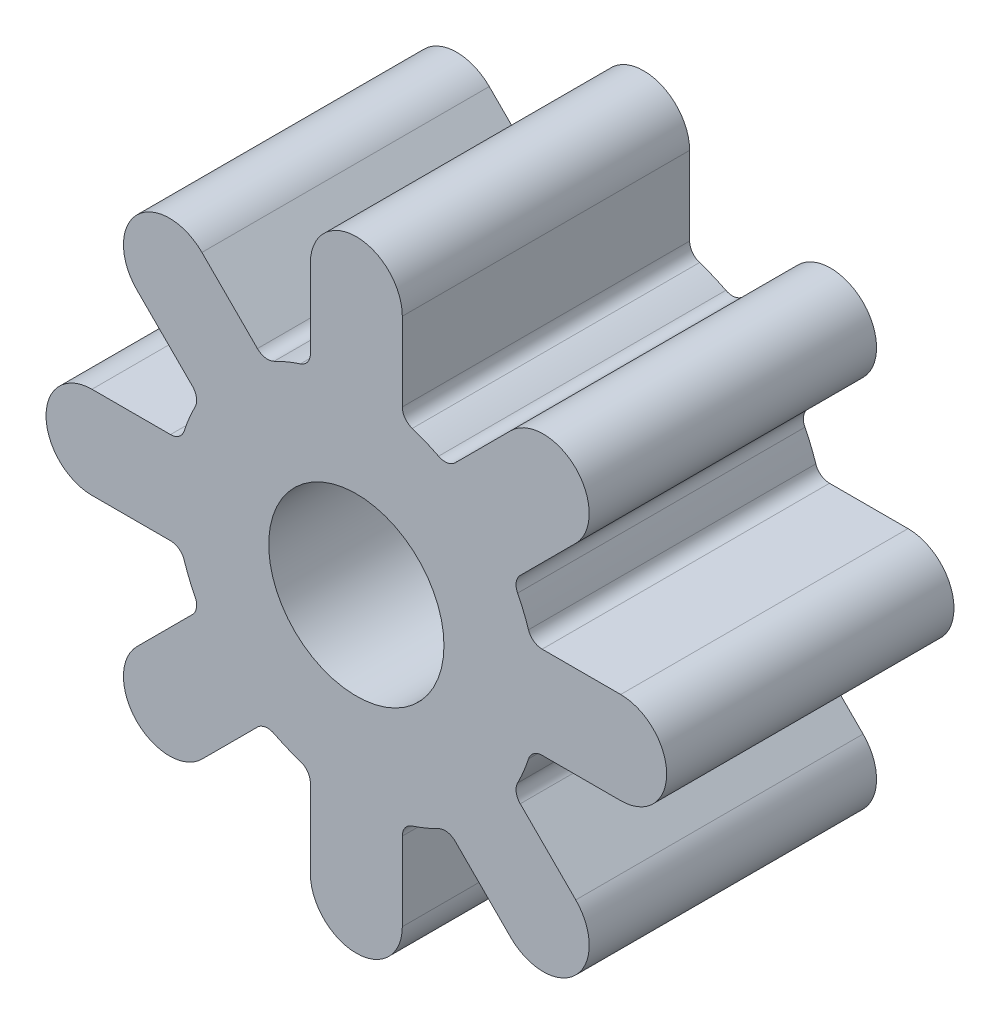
ISO-10303-21;
HEADER;
FILE_DESCRIPTION(('STEP AP214'),'2;1');
FILE_NAME('part.step','',(''),(''),'','','');
FILE_SCHEMA(('AUTOMOTIVE_DESIGN { 1 0 10303 214 1 1 1 1 }'));
ENDSEC;
DATA;
#1=APPLICATION_CONTEXT('core data for automotive mechanical design processes');
#2=APPLICATION_PROTOCOL_DEFINITION('international standard','automotive_design',2000,#1);
#3=PRODUCT_CONTEXT('',#1,'mechanical');
#4=PRODUCT('Part','Part','',(#3));
#5=PRODUCT_RELATED_PRODUCT_CATEGORY('part','',(#4));
#6=PRODUCT_DEFINITION_FORMATION('','',#4);
#7=PRODUCT_DEFINITION_CONTEXT('part definition',#1,'design');
#8=PRODUCT_DEFINITION('design','',#6,#7);
#9=PRODUCT_DEFINITION_SHAPE('','',#8);
#10=(LENGTH_UNIT() NAMED_UNIT(*) SI_UNIT(.MILLI.,.METRE.));
#11=(NAMED_UNIT(*) PLANE_ANGLE_UNIT() SI_UNIT($,.RADIAN.));
#12=(NAMED_UNIT(*) SI_UNIT($,.STERADIAN.) SOLID_ANGLE_UNIT());
#13=UNCERTAINTY_MEASURE_WITH_UNIT(LENGTH_MEASURE(1.E-05),#10,'distance_accuracy_value','');
#14=(GEOMETRIC_REPRESENTATION_CONTEXT(3) GLOBAL_UNCERTAINTY_ASSIGNED_CONTEXT((#13)) GLOBAL_UNIT_ASSIGNED_CONTEXT((#10,
#11,#12)) REPRESENTATION_CONTEXT('',''));
#15=CARTESIAN_POINT('',(0.,0.,0.));
#16=DIRECTION('',(0.,0.,1.));
#17=DIRECTION('',(1.,0.,0.));
#18=AXIS2_PLACEMENT_3D('',#15,#16,#17);
#19=CARTESIAN_POINT('',(2.1,6.46761161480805,10.));
#20=DIRECTION('',(0.,0.,-1.));
#21=DIRECTION('',(-1.,0.,0.));
#22=AXIS2_PLACEMENT_3D('',#19,#20,#21);
#23=CYLINDRICAL_SURFACE('',#22,0.499999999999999);
#24=CARTESIAN_POINT('',(2.1,6.46761161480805,0.));
#25=DIRECTION('',(0.,0.,-1.));
#26=DIRECTION('',(1.,0.,0.));
#27=AXIS2_PLACEMENT_3D('',#24,#25,#26);
#28=CIRCLE('',#27,0.499999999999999);
#29=CARTESIAN_POINT('',(1.94558823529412,5.99205193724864,0.));
#30=VERTEX_POINT('',#29);
#31=CARTESIAN_POINT('',(1.6,6.46761161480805,0.));
#32=VERTEX_POINT('',#31);
#33=EDGE_CURVE('E368',#30,#32,#28,.T.);
#34=ORIENTED_EDGE('',*,*,#33,.T.);
#35=DIRECTION('',(0.,0.,-1.));
#36=VECTOR('',#35,1.);
#37=CARTESIAN_POINT('',(1.6,6.46761161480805,10.));
#38=LINE('',#37,#36);
#39=CARTESIAN_POINT('',(1.6,6.46761161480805,10.));
#40=VERTEX_POINT('',#39);
#41=EDGE_CURVE('E11',#40,#32,#38,.T.);
#42=ORIENTED_EDGE('',*,*,#41,.F.);
#43=CARTESIAN_POINT('',(2.1,6.46761161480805,10.));
#44=DIRECTION('',(0.,0.,-1.));
#45=DIRECTION('',(1.,0.,0.));
#46=AXIS2_PLACEMENT_3D('',#43,#44,#45);
#47=CIRCLE('',#46,0.499999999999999);
#48=CARTESIAN_POINT('',(1.94558823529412,5.99205193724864,10.));
#49=VERTEX_POINT('',#48);
#50=EDGE_CURVE('E463',#49,#40,#47,.T.);
#51=ORIENTED_EDGE('',*,*,#50,.F.);
#52=DIRECTION('',(0.,0.,-1.));
#53=VECTOR('',#52,1.);
#54=CARTESIAN_POINT('',(1.94558823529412,5.99205193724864,10.));
#55=LINE('',#54,#53);
#56=EDGE_CURVE('E364',#49,#30,#55,.T.);
#57=ORIENTED_EDGE('',*,*,#56,.T.);
#58=EDGE_LOOP('',(#34,#42,#51,#57));
#59=FACE_BOUND('',#58,.T.);
#60=ADVANCED_FACE('F32',(#59),#23,.F.);
#61=CARTESIAN_POINT('',(1.6,9.2,10.));
#62=DIRECTION('',(-1.,0.,0.));
#63=DIRECTION('',(0.,0.,1.));
#64=AXIS2_PLACEMENT_3D('',#61,#62,#63);
#65=PLANE('',#64);
#66=DIRECTION('',(0.,1.,0.));
#67=VECTOR('',#66,1.);
#68=CARTESIAN_POINT('',(1.6,9.2,0.));
#69=LINE('',#68,#67);
#70=CARTESIAN_POINT('',(1.6,9.2,0.));
#71=VERTEX_POINT('',#70);
#72=EDGE_CURVE('E371',#32,#71,#69,.T.);
#73=ORIENTED_EDGE('',*,*,#72,.T.);
#74=DIRECTION('',(0.,0.,-1.));
#75=VECTOR('',#74,1.);
#76=CARTESIAN_POINT('',(1.6,9.2,10.));
#77=LINE('',#76,#75);
#78=CARTESIAN_POINT('',(1.6,9.2,10.));
#79=VERTEX_POINT('',#78);
#80=EDGE_CURVE('E40',#79,#71,#77,.T.);
#81=ORIENTED_EDGE('',*,*,#80,.F.);
#82=DIRECTION('',(0.,1.,0.));
#83=VECTOR('',#82,1.);
#84=CARTESIAN_POINT('',(1.6,9.2,10.));
#85=LINE('',#84,#83);
#86=EDGE_CURVE('E211',#40,#79,#85,.T.);
#87=ORIENTED_EDGE('',*,*,#86,.F.);
#88=ORIENTED_EDGE('',*,*,#41,.T.);
#89=EDGE_LOOP('',(#73,#81,#87,#88));
#90=FACE_BOUND('',#89,.T.);
#91=ADVANCED_FACE('F722',(#90),#65,.F.);
#92=CARTESIAN_POINT('',(0.,9.2,10.));
#93=DIRECTION('',(0.,0.,-1.));
#94=DIRECTION('',(-1.,0.,0.));
#95=AXIS2_PLACEMENT_3D('',#92,#93,#94);
#96=CYLINDRICAL_SURFACE('',#95,1.6);
#97=CARTESIAN_POINT('',(0.,9.2,0.));
#98=DIRECTION('',(0.,0.,1.));
#99=DIRECTION('',(1.,0.,0.));
#100=AXIS2_PLACEMENT_3D('',#97,#98,#99);
#101=CIRCLE('',#100,1.6);
#102=CARTESIAN_POINT('',(-1.6,9.2,0.));
#103=VERTEX_POINT('',#102);
#104=EDGE_CURVE('E374',#71,#103,#101,.T.);
#105=ORIENTED_EDGE('',*,*,#104,.T.);
#106=DIRECTION('',(0.,0.,-1.));
#107=VECTOR('',#106,1.);
#108=CARTESIAN_POINT('',(-1.6,9.2,10.));
#109=LINE('',#108,#107);
#110=CARTESIAN_POINT('',(-1.6,9.2,10.));
#111=VERTEX_POINT('',#110);
#112=EDGE_CURVE('E590',#111,#103,#109,.T.);
#113=ORIENTED_EDGE('',*,*,#112,.F.);
#114=CARTESIAN_POINT('',(0.,9.2,10.));
#115=DIRECTION('',(0.,0.,1.));
#116=DIRECTION('',(1.,0.,0.));
#117=AXIS2_PLACEMENT_3D('',#114,#115,#116);
#118=CIRCLE('',#117,1.6);
#119=EDGE_CURVE('E598',#79,#111,#118,.T.);
#120=ORIENTED_EDGE('',*,*,#119,.F.);
#121=ORIENTED_EDGE('',*,*,#80,.T.);
#122=EDGE_LOOP('',(#105,#113,#120,#121));
#123=FACE_BOUND('',#122,.T.);
#124=ADVANCED_FACE('F596',(#123),#96,.T.);
#125=CARTESIAN_POINT('',(-1.6,9.2,10.));
#126=DIRECTION('',(1.,0.,0.));
#127=DIRECTION('',(0.,0.,-1.));
#128=AXIS2_PLACEMENT_3D('',#125,#126,#127);
#129=PLANE('',#128);
#130=DIRECTION('',(0.,-1.,0.));
#131=VECTOR('',#130,1.);
#132=CARTESIAN_POINT('',(-1.6,9.2,0.));
#133=LINE('',#132,#131);
#134=CARTESIAN_POINT('',(-1.6,6.46761161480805,0.));
#135=VERTEX_POINT('',#134);
#136=EDGE_CURVE('E376',#103,#135,#133,.T.);
#137=ORIENTED_EDGE('',*,*,#136,.T.);
#138=DIRECTION('',(0.,0.,-1.));
#139=VECTOR('',#138,1.);
#140=CARTESIAN_POINT('',(-1.6,6.46761161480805,10.));
#141=LINE('',#140,#139);
#142=CARTESIAN_POINT('',(-1.6,6.46761161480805,10.));
#143=VERTEX_POINT('',#142);
#144=EDGE_CURVE('E587',#143,#135,#141,.T.);
#145=ORIENTED_EDGE('',*,*,#144,.F.);
#146=DIRECTION('',(0.,-1.,0.));
#147=VECTOR('',#146,1.);
#148=CARTESIAN_POINT('',(-1.6,9.2,10.));
#149=LINE('',#148,#147);
#150=EDGE_CURVE('E616',#111,#143,#149,.T.);
#151=ORIENTED_EDGE('',*,*,#150,.F.);
#152=ORIENTED_EDGE('',*,*,#112,.T.);
#153=EDGE_LOOP('',(#137,#145,#151,#152));
#154=FACE_BOUND('',#153,.T.);
#155=ADVANCED_FACE('F607',(#154),#129,.F.);
#156=CARTESIAN_POINT('',(-2.1,6.46761161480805,10.));
#157=DIRECTION('',(0.,0.,-1.));
#158=DIRECTION('',(-1.,0.,0.));
#159=AXIS2_PLACEMENT_3D('',#156,#157,#158);
#160=CYLINDRICAL_SURFACE('',#159,0.499999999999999);
#161=CARTESIAN_POINT('',(-2.1,6.46761161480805,0.));
#162=DIRECTION('',(0.,0.,-1.));
#163=DIRECTION('',(-1.,0.,0.));
#164=AXIS2_PLACEMENT_3D('',#161,#162,#163);
#165=CIRCLE('',#164,0.499999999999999);
#166=CARTESIAN_POINT('',(-1.94558823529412,5.99205193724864,0.));
#167=VERTEX_POINT('',#166);
#168=EDGE_CURVE('E378',#135,#167,#165,.T.);
#169=ORIENTED_EDGE('',*,*,#168,.T.);
#170=DIRECTION('',(0.,0.,-1.));
#171=VECTOR('',#170,1.);
#172=CARTESIAN_POINT('',(-1.94558823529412,5.99205193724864,10.));
#173=LINE('',#172,#171);
#174=CARTESIAN_POINT('',(-1.94558823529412,5.99205193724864,10.));
#175=VERTEX_POINT('',#174);
#176=EDGE_CURVE('E584',#175,#167,#173,.T.);
#177=ORIENTED_EDGE('',*,*,#176,.F.);
#178=CARTESIAN_POINT('',(-2.1,6.46761161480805,10.));
#179=DIRECTION('',(0.,0.,-1.));
#180=DIRECTION('',(-1.,0.,0.));
#181=AXIS2_PLACEMENT_3D('',#178,#179,#180);
#182=CIRCLE('',#181,0.499999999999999);
#183=EDGE_CURVE('E613',#143,#175,#182,.T.);
#184=ORIENTED_EDGE('',*,*,#183,.F.);
#185=ORIENTED_EDGE('',*,*,#144,.T.);
#186=EDGE_LOOP('',(#169,#177,#184,#185));
#187=FACE_BOUND('',#186,.T.);
#188=ADVANCED_FACE('F611',(#187),#160,.F.);
#189=CARTESIAN_POINT('',(0.,0.,10.));
#190=DIRECTION('',(0.,0.,-1.));
#191=DIRECTION('',(-1.,0.,0.));
#192=AXIS2_PLACEMENT_3D('',#189,#190,#191);
#193=CYLINDRICAL_SURFACE('',#192,6.3);
#194=CARTESIAN_POINT('',(0.,0.,0.));
#195=DIRECTION('',(0.,0.,1.));
#196=DIRECTION('',(1.,0.,0.));
#197=AXIS2_PLACEMENT_3D('',#194,#195,#196);
#198=CIRCLE('',#197,6.3);
#199=CARTESIAN_POINT('',(-2.86128192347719,5.61275919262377,0.));
#200=VERTEX_POINT('',#199);
#201=EDGE_CURVE('E380',#167,#200,#198,.T.);
#202=ORIENTED_EDGE('',*,*,#201,.T.);
#203=DIRECTION('',(0.,0.,-1.));
#204=VECTOR('',#203,1.);
#205=CARTESIAN_POINT('',(-2.86128192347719,5.61275919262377,10.));
#206=LINE('',#205,#204);
#207=CARTESIAN_POINT('',(-2.86128192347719,5.61275919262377,10.));
#208=VERTEX_POINT('',#207);
#209=EDGE_CURVE('E581',#208,#200,#206,.T.);
#210=ORIENTED_EDGE('',*,*,#209,.F.);
#211=CARTESIAN_POINT('',(0.,0.,10.));
#212=DIRECTION('',(0.,0.,1.));
#213=DIRECTION('',(1.,0.,0.));
#214=AXIS2_PLACEMENT_3D('',#211,#212,#213);
#215=CIRCLE('',#214,6.3);
#216=EDGE_CURVE('E615',#175,#208,#215,.T.);
#217=ORIENTED_EDGE('',*,*,#216,.F.);
#218=ORIENTED_EDGE('',*,*,#176,.T.);
#219=EDGE_LOOP('',(#202,#210,#217,#218));
#220=FACE_BOUND('',#219,.T.);
#221=ADVANCED_FACE('F735',(#220),#193,.T.);
#222=CARTESIAN_POINT('',(-3.08836779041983,6.05821627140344,10.));
#223=DIRECTION('',(0.,0.,-1.));
#224=DIRECTION('',(-1.,0.,0.));
#225=AXIS2_PLACEMENT_3D('',#222,#223,#224);
#226=CYLINDRICAL_SURFACE('',#225,0.499999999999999);
#227=CARTESIAN_POINT('',(-3.08836779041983,6.05821627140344,0.));
#228=DIRECTION('',(0.,0.,-1.));
#229=DIRECTION('',(1.,0.,0.));
#230=AXIS2_PLACEMENT_3D('',#227,#228,#229);
#231=CIRCLE('',#230,0.499999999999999);
#232=CARTESIAN_POINT('',(-3.4419211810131,5.70466288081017,0.));
#233=VERTEX_POINT('',#232);
#234=EDGE_CURVE('E382',#200,#233,#231,.T.);
#235=ORIENTED_EDGE('',*,*,#234,.T.);
#236=DIRECTION('',(0.,0.,-1.));
#237=VECTOR('',#236,1.);
#238=CARTESIAN_POINT('',(-3.4419211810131,5.70466288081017,10.));
#239=LINE('',#238,#237);
#240=CARTESIAN_POINT('',(-3.4419211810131,5.70466288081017,10.));
#241=VERTEX_POINT('',#240);
#242=EDGE_CURVE('E578',#241,#233,#239,.T.);
#243=ORIENTED_EDGE('',*,*,#242,.F.);
#244=CARTESIAN_POINT('',(-3.08836779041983,6.05821627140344,10.));
#245=DIRECTION('',(0.,0.,-1.));
#246=DIRECTION('',(1.,0.,0.));
#247=AXIS2_PLACEMENT_3D('',#244,#245,#246);
#248=CIRCLE('',#247,0.499999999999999);
#249=EDGE_CURVE('E618',#208,#241,#248,.T.);
#250=ORIENTED_EDGE('',*,*,#249,.F.);
#251=ORIENTED_EDGE('',*,*,#209,.T.);
#252=EDGE_LOOP('',(#235,#243,#250,#251));
#253=FACE_BOUND('',#252,.T.);
#254=ADVANCED_FACE('F738',(#253),#226,.F.);
#255=CARTESIAN_POINT('',(-5.37401153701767,7.63675323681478,10.));
#256=DIRECTION('',(-0.707106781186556,-0.707106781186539,0.));
#257=DIRECTION('',(0.707106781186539,-0.707106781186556,0.));
#258=AXIS2_PLACEMENT_3D('',#255,#256,#257);
#259=PLANE('',#258);
#260=DIRECTION('',(-0.707106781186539,0.707106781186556,0.));
#261=VECTOR('',#260,1.);
#262=CARTESIAN_POINT('',(-5.37401153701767,7.63675323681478,0.));
#263=LINE('',#262,#261);
#264=CARTESIAN_POINT('',(-5.37401153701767,7.63675323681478,0.));
#265=VERTEX_POINT('',#264);
#266=EDGE_CURVE('E384',#233,#265,#263,.T.);
#267=ORIENTED_EDGE('',*,*,#266,.T.);
#268=DIRECTION('',(0.,0.,-1.));
#269=VECTOR('',#268,1.);
#270=CARTESIAN_POINT('',(-5.37401153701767,7.63675323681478,10.));
#271=LINE('',#270,#269);
#272=CARTESIAN_POINT('',(-5.37401153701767,7.63675323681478,10.));
#273=VERTEX_POINT('',#272);
#274=EDGE_CURVE('E575',#273,#265,#271,.T.);
#275=ORIENTED_EDGE('',*,*,#274,.F.);
#276=DIRECTION('',(-0.707106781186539,0.707106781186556,0.));
#277=VECTOR('',#276,1.);
#278=CARTESIAN_POINT('',(-5.37401153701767,7.63675323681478,10.));
#279=LINE('',#278,#277);
#280=EDGE_CURVE('E624',#241,#273,#279,.T.);
#281=ORIENTED_EDGE('',*,*,#280,.F.);
#282=ORIENTED_EDGE('',*,*,#242,.T.);
#283=EDGE_LOOP('',(#267,#275,#281,#282));
#284=FACE_BOUND('',#283,.T.);
#285=ADVANCED_FACE('F742',(#284),#259,.F.);
#286=CARTESIAN_POINT('',(-6.50538238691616,6.50538238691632,10.));
#287=DIRECTION('',(0.,0.,-1.));
#288=DIRECTION('',(-1.,0.,0.));
#289=AXIS2_PLACEMENT_3D('',#286,#287,#288);
#290=CYLINDRICAL_SURFACE('',#289,1.6);
#291=CARTESIAN_POINT('',(-6.50538238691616,6.50538238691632,0.));
#292=DIRECTION('',(0.,0.,1.));
#293=DIRECTION('',(1.,0.,0.));
#294=AXIS2_PLACEMENT_3D('',#291,#292,#293);
#295=CIRCLE('',#294,1.6);
#296=CARTESIAN_POINT('',(-7.63675323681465,5.37401153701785,0.));
#297=VERTEX_POINT('',#296);
#298=EDGE_CURVE('E386',#265,#297,#295,.T.);
#299=ORIENTED_EDGE('',*,*,#298,.T.);
#300=DIRECTION('',(0.,0.,-1.));
#301=VECTOR('',#300,1.);
#302=CARTESIAN_POINT('',(-7.63675323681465,5.37401153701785,10.));
#303=LINE('',#302,#301);
#304=CARTESIAN_POINT('',(-7.63675323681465,5.37401153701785,10.));
#305=VERTEX_POINT('',#304);
#306=EDGE_CURVE('E572',#305,#297,#303,.T.);
#307=ORIENTED_EDGE('',*,*,#306,.F.);
#308=CARTESIAN_POINT('',(-6.50538238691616,6.50538238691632,10.));
#309=DIRECTION('',(0.,0.,1.));
#310=DIRECTION('',(1.,0.,0.));
#311=AXIS2_PLACEMENT_3D('',#308,#309,#310);
#312=CIRCLE('',#311,1.6);
#313=EDGE_CURVE('E626',#273,#305,#312,.T.);
#314=ORIENTED_EDGE('',*,*,#313,.F.);
#315=ORIENTED_EDGE('',*,*,#274,.T.);
#316=EDGE_LOOP('',(#299,#307,#314,#315));
#317=FACE_BOUND('',#316,.T.);
#318=ADVANCED_FACE('F746',(#317),#290,.T.);
#319=CARTESIAN_POINT('',(-7.63675323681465,5.37401153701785,10.));
#320=DIRECTION('',(0.707106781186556,0.707106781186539,0.));
#321=DIRECTION('',(-0.707106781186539,0.707106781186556,0.));
#322=AXIS2_PLACEMENT_3D('',#319,#320,#321);
#323=PLANE('',#322);
#324=DIRECTION('',(0.707106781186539,-0.707106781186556,0.));
#325=VECTOR('',#324,1.);
#326=CARTESIAN_POINT('',(-7.63675323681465,5.37401153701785,0.));
#327=LINE('',#326,#325);
#328=CARTESIAN_POINT('',(-5.70466288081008,3.44192118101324,0.));
#329=VERTEX_POINT('',#328);
#330=EDGE_CURVE('E388',#297,#329,#327,.T.);
#331=ORIENTED_EDGE('',*,*,#330,.T.);
#332=DIRECTION('',(0.,0.,-1.));
#333=VECTOR('',#332,1.);
#334=CARTESIAN_POINT('',(-5.70466288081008,3.44192118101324,10.));
#335=LINE('',#334,#333);
#336=CARTESIAN_POINT('',(-5.70466288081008,3.44192118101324,10.));
#337=VERTEX_POINT('',#336);
#338=EDGE_CURVE('E569',#337,#329,#335,.T.);
#339=ORIENTED_EDGE('',*,*,#338,.F.);
#340=DIRECTION('',(0.707106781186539,-0.707106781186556,0.));
#341=VECTOR('',#340,1.);
#342=CARTESIAN_POINT('',(-7.63675323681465,5.37401153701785,10.));
#343=LINE('',#342,#341);
#344=EDGE_CURVE('E628',#305,#337,#343,.T.);
#345=ORIENTED_EDGE('',*,*,#344,.F.);
#346=ORIENTED_EDGE('',*,*,#306,.T.);
#347=EDGE_LOOP('',(#331,#339,#345,#346));
#348=FACE_BOUND('',#347,.T.);
#349=ADVANCED_FACE('F750',(#348),#323,.F.);
#350=CARTESIAN_POINT('',(-6.05821627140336,3.08836779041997,10.));
#351=DIRECTION('',(0.,0.,-1.));
#352=DIRECTION('',(-1.,0.,0.));
#353=AXIS2_PLACEMENT_3D('',#350,#351,#352);
#354=CYLINDRICAL_SURFACE('',#353,0.499999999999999);
#355=CARTESIAN_POINT('',(-6.05821627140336,3.08836779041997,0.));
#356=DIRECTION('',(0.,0.,-1.));
#357=DIRECTION('',(-1.,0.,0.));
#358=AXIS2_PLACEMENT_3D('',#355,#356,#357);
#359=CIRCLE('',#358,0.499999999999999);
#360=CARTESIAN_POINT('',(-5.61275919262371,2.86128192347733,0.));
#361=VERTEX_POINT('',#360);
#362=EDGE_CURVE('E390',#329,#361,#359,.T.);
#363=ORIENTED_EDGE('',*,*,#362,.T.);
#364=DIRECTION('',(0.,0.,-1.));
#365=VECTOR('',#364,1.);
#366=CARTESIAN_POINT('',(-5.61275919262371,2.86128192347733,10.));
#367=LINE('',#366,#365);
#368=CARTESIAN_POINT('',(-5.61275919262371,2.86128192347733,10.));
#369=VERTEX_POINT('',#368);
#370=EDGE_CURVE('E566',#369,#361,#367,.T.);
#371=ORIENTED_EDGE('',*,*,#370,.F.);
#372=CARTESIAN_POINT('',(-6.05821627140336,3.08836779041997,10.));
#373=DIRECTION('',(0.,0.,-1.));
#374=DIRECTION('',(-1.,0.,0.));
#375=AXIS2_PLACEMENT_3D('',#372,#373,#374);
#376=CIRCLE('',#375,0.499999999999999);
#377=EDGE_CURVE('E630',#337,#369,#376,.T.);
#378=ORIENTED_EDGE('',*,*,#377,.F.);
#379=ORIENTED_EDGE('',*,*,#338,.T.);
#380=EDGE_LOOP('',(#363,#371,#378,#379));
#381=FACE_BOUND('',#380,.T.);
#382=ADVANCED_FACE('F754',(#381),#354,.F.);
#383=CARTESIAN_POINT('',(0.,0.,10.));
#384=DIRECTION('',(0.,0.,-1.));
#385=DIRECTION('',(-1.,0.,0.));
#386=AXIS2_PLACEMENT_3D('',#383,#384,#385);
#387=CYLINDRICAL_SURFACE('',#386,6.3);
#388=CARTESIAN_POINT('',(0.,0.,0.));
#389=DIRECTION('',(0.,0.,1.));
#390=DIRECTION('',(1.,0.,0.));
#391=AXIS2_PLACEMENT_3D('',#388,#389,#390);
#392=CIRCLE('',#391,6.3);
#393=CARTESIAN_POINT('',(-5.99205193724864,1.94558823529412,0.));
#394=VERTEX_POINT('',#393);
#395=EDGE_CURVE('E392',#361,#394,#392,.T.);
#396=ORIENTED_EDGE('',*,*,#395,.T.);
#397=DIRECTION('',(0.,0.,-1.));
#398=VECTOR('',#397,1.);
#399=CARTESIAN_POINT('',(-5.99205193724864,1.94558823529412,10.));
#400=LINE('',#399,#398);
#401=CARTESIAN_POINT('',(-5.99205193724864,1.94558823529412,10.));
#402=VERTEX_POINT('',#401);
#403=EDGE_CURVE('E563',#402,#394,#400,.T.);
#404=ORIENTED_EDGE('',*,*,#403,.F.);
#405=CARTESIAN_POINT('',(0.,0.,10.));
#406=DIRECTION('',(0.,0.,1.));
#407=DIRECTION('',(1.,0.,0.));
#408=AXIS2_PLACEMENT_3D('',#405,#406,#407);
#409=CIRCLE('',#408,6.3);
#410=EDGE_CURVE('E632',#369,#402,#409,.T.);
#411=ORIENTED_EDGE('',*,*,#410,.F.);
#412=ORIENTED_EDGE('',*,*,#370,.T.);
#413=EDGE_LOOP('',(#396,#404,#411,#412));
#414=FACE_BOUND('',#413,.T.);
#415=ADVANCED_FACE('F758',(#414),#387,.T.);
#416=CARTESIAN_POINT('',(-6.46761161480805,2.1,10.));
#417=DIRECTION('',(0.,0.,-1.));
#418=DIRECTION('',(-1.,0.,0.));
#419=AXIS2_PLACEMENT_3D('',#416,#417,#418);
#420=CYLINDRICAL_SURFACE('',#419,0.500000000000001);
#421=CARTESIAN_POINT('',(-6.46761161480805,2.1,0.));
#422=DIRECTION('',(0.,0.,-1.));
#423=DIRECTION('',(1.,0.,0.));
#424=AXIS2_PLACEMENT_3D('',#421,#422,#423);
#425=CIRCLE('',#424,0.500000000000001);
#426=CARTESIAN_POINT('',(-6.46761161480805,1.6,0.));
#427=VERTEX_POINT('',#426);
#428=EDGE_CURVE('E394',#394,#427,#425,.T.);
#429=ORIENTED_EDGE('',*,*,#428,.T.);
#430=DIRECTION('',(0.,0.,-1.));
#431=VECTOR('',#430,1.);
#432=CARTESIAN_POINT('',(-6.46761161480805,1.6,10.));
#433=LINE('',#432,#431);
#434=CARTESIAN_POINT('',(-6.46761161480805,1.6,10.));
#435=VERTEX_POINT('',#434);
#436=EDGE_CURVE('E560',#435,#427,#433,.T.);
#437=ORIENTED_EDGE('',*,*,#436,.F.);
#438=CARTESIAN_POINT('',(-6.46761161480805,2.1,10.));
#439=DIRECTION('',(0.,0.,-1.));
#440=DIRECTION('',(1.,0.,0.));
#441=AXIS2_PLACEMENT_3D('',#438,#439,#440);
#442=CIRCLE('',#441,0.500000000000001);
#443=EDGE_CURVE('E634',#402,#435,#442,.T.);
#444=ORIENTED_EDGE('',*,*,#443,.F.);
#445=ORIENTED_EDGE('',*,*,#403,.T.);
#446=EDGE_LOOP('',(#429,#437,#444,#445));
#447=FACE_BOUND('',#446,.T.);
#448=ADVANCED_FACE('F762',(#447),#420,.F.);
#449=CARTESIAN_POINT('',(-9.19999999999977,1.59999999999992,10.));
#450=DIRECTION('',(0.,-1.,0.));
#451=DIRECTION('',(1.,0.,0.));
#452=AXIS2_PLACEMENT_3D('',#449,#450,#451);
#453=PLANE('',#452);
#454=DIRECTION('',(-1.,0.,0.));
#455=VECTOR('',#454,1.);
#456=CARTESIAN_POINT('',(-9.19999999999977,1.59999999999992,0.));
#457=LINE('',#456,#455);
#458=CARTESIAN_POINT('',(-9.19999999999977,1.59999999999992,0.));
#459=VERTEX_POINT('',#458);
#460=EDGE_CURVE('E396',#427,#459,#457,.T.);
#461=ORIENTED_EDGE('',*,*,#460,.T.);
#462=DIRECTION('',(0.,0.,-1.));
#463=VECTOR('',#462,1.);
#464=CARTESIAN_POINT('',(-9.19999999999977,1.59999999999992,10.));
#465=LINE('',#464,#463);
#466=CARTESIAN_POINT('',(-9.19999999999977,1.59999999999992,10.));
#467=VERTEX_POINT('',#466);
#468=EDGE_CURVE('E557',#467,#459,#465,.T.);
#469=ORIENTED_EDGE('',*,*,#468,.F.);
#470=DIRECTION('',(-1.,0.,0.));
#471=VECTOR('',#470,1.);
#472=CARTESIAN_POINT('',(-9.19999999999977,1.59999999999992,10.));
#473=LINE('',#472,#471);
#474=EDGE_CURVE('E636',#435,#467,#473,.T.);
#475=ORIENTED_EDGE('',*,*,#474,.F.);
#476=ORIENTED_EDGE('',*,*,#436,.T.);
#477=EDGE_LOOP('',(#461,#469,#475,#476));
#478=FACE_BOUND('',#477,.T.);
#479=ADVANCED_FACE('F766',(#478),#453,.F.);
#480=CARTESIAN_POINT('',(-9.19999999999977,0.,10.));
#481=DIRECTION('',(0.,0.,-1.));
#482=DIRECTION('',(-1.,0.,0.));
#483=AXIS2_PLACEMENT_3D('',#480,#481,#482);
#484=CYLINDRICAL_SURFACE('',#483,1.6);
#485=CARTESIAN_POINT('',(-9.19999999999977,0.,0.));
#486=DIRECTION('',(0.,0.,1.));
#487=DIRECTION('',(1.,0.,0.));
#488=AXIS2_PLACEMENT_3D('',#485,#486,#487);
#489=CIRCLE('',#488,1.6);
#490=CARTESIAN_POINT('',(-9.19999999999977,-1.60000000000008,0.));
#491=VERTEX_POINT('',#490);
#492=EDGE_CURVE('E398',#459,#491,#489,.T.);
#493=ORIENTED_EDGE('',*,*,#492,.T.);
#494=DIRECTION('',(0.,0.,-1.));
#495=VECTOR('',#494,1.);
#496=CARTESIAN_POINT('',(-9.19999999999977,-1.60000000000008,10.));
#497=LINE('',#496,#495);
#498=CARTESIAN_POINT('',(-9.19999999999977,-1.60000000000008,10.));
#499=VERTEX_POINT('',#498);
#500=EDGE_CURVE('E554',#499,#491,#497,.T.);
#501=ORIENTED_EDGE('',*,*,#500,.F.);
#502=CARTESIAN_POINT('',(-9.19999999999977,0.,10.));
#503=DIRECTION('',(0.,0.,1.));
#504=DIRECTION('',(1.,0.,0.));
#505=AXIS2_PLACEMENT_3D('',#502,#503,#504);
#506=CIRCLE('',#505,1.6);
#507=EDGE_CURVE('E638',#467,#499,#506,.T.);
#508=ORIENTED_EDGE('',*,*,#507,.F.);
#509=ORIENTED_EDGE('',*,*,#468,.T.);
#510=EDGE_LOOP('',(#493,#501,#508,#509));
#511=FACE_BOUND('',#510,.T.);
#512=ADVANCED_FACE('F770',(#511),#484,.T.);
#513=CARTESIAN_POINT('',(-9.19999999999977,-1.60000000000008,10.));
#514=DIRECTION('',(0.,1.,0.));
#515=DIRECTION('',(-1.,0.,0.));
#516=AXIS2_PLACEMENT_3D('',#513,#514,#515);
#517=PLANE('',#516);
#518=DIRECTION('',(1.,0.,0.));
#519=VECTOR('',#518,1.);
#520=CARTESIAN_POINT('',(-9.19999999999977,-1.60000000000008,0.));
#521=LINE('',#520,#519);
#522=CARTESIAN_POINT('',(-6.46761161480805,-1.6,0.));
#523=VERTEX_POINT('',#522);
#524=EDGE_CURVE('E400',#491,#523,#521,.T.);
#525=ORIENTED_EDGE('',*,*,#524,.T.);
#526=DIRECTION('',(0.,0.,-1.));
#527=VECTOR('',#526,1.);
#528=CARTESIAN_POINT('',(-6.46761161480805,-1.6,10.));
#529=LINE('',#528,#527);
#530=CARTESIAN_POINT('',(-6.46761161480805,-1.6,10.));
#531=VERTEX_POINT('',#530);
#532=EDGE_CURVE('E551',#531,#523,#529,.T.);
#533=ORIENTED_EDGE('',*,*,#532,.F.);
#534=DIRECTION('',(1.,0.,0.));
#535=VECTOR('',#534,1.);
#536=CARTESIAN_POINT('',(-9.19999999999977,-1.60000000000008,10.));
#537=LINE('',#536,#535);
#538=EDGE_CURVE('E640',#499,#531,#537,.T.);
#539=ORIENTED_EDGE('',*,*,#538,.F.);
#540=ORIENTED_EDGE('',*,*,#500,.T.);
#541=EDGE_LOOP('',(#525,#533,#539,#540));
#542=FACE_BOUND('',#541,.T.);
#543=ADVANCED_FACE('F774',(#542),#517,.F.);
#544=CARTESIAN_POINT('',(-6.46761161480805,-2.1,10.));
#545=DIRECTION('',(0.,0.,-1.));
#546=DIRECTION('',(-1.,0.,0.));
#547=AXIS2_PLACEMENT_3D('',#544,#545,#546);
#548=CYLINDRICAL_SURFACE('',#547,0.499999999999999);
#549=CARTESIAN_POINT('',(-6.46761161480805,-2.1,0.));
#550=DIRECTION('',(0.,0.,-1.));
#551=DIRECTION('',(-1.,0.,0.));
#552=AXIS2_PLACEMENT_3D('',#549,#550,#551);
#553=CIRCLE('',#552,0.499999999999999);
#554=CARTESIAN_POINT('',(-5.99205193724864,-1.94558823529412,0.));
#555=VERTEX_POINT('',#554);
#556=EDGE_CURVE('E402',#523,#555,#553,.T.);
#557=ORIENTED_EDGE('',*,*,#556,.T.);
#558=DIRECTION('',(0.,0.,-1.));
#559=VECTOR('',#558,1.);
#560=CARTESIAN_POINT('',(-5.99205193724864,-1.94558823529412,10.));
#561=LINE('',#560,#559);
#562=CARTESIAN_POINT('',(-5.99205193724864,-1.94558823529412,10.));
#563=VERTEX_POINT('',#562);
#564=EDGE_CURVE('E548',#563,#555,#561,.T.);
#565=ORIENTED_EDGE('',*,*,#564,.F.);
#566=CARTESIAN_POINT('',(-6.46761161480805,-2.1,10.));
#567=DIRECTION('',(0.,0.,-1.));
#568=DIRECTION('',(-1.,0.,0.));
#569=AXIS2_PLACEMENT_3D('',#566,#567,#568);
#570=CIRCLE('',#569,0.499999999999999);
#571=EDGE_CURVE('E642',#531,#563,#570,.T.);
#572=ORIENTED_EDGE('',*,*,#571,.F.);
#573=ORIENTED_EDGE('',*,*,#532,.T.);
#574=EDGE_LOOP('',(#557,#565,#572,#573));
#575=FACE_BOUND('',#574,.T.);
#576=ADVANCED_FACE('F778',(#575),#548,.F.);
#577=CARTESIAN_POINT('',(0.,0.,10.));
#578=DIRECTION('',(0.,0.,-1.));
#579=DIRECTION('',(-1.,0.,0.));
#580=AXIS2_PLACEMENT_3D('',#577,#578,#579);
#581=CYLINDRICAL_SURFACE('',#580,6.3);
#582=CARTESIAN_POINT('',(0.,0.,0.));
#583=DIRECTION('',(0.,0.,1.));
#584=DIRECTION('',(1.,0.,0.));
#585=AXIS2_PLACEMENT_3D('',#582,#583,#584);
#586=CIRCLE('',#585,6.3);
#587=CARTESIAN_POINT('',(-5.61275919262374,-2.86128192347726,0.));
#588=VERTEX_POINT('',#587);
#589=EDGE_CURVE('E404',#555,#588,#586,.T.);
#590=ORIENTED_EDGE('',*,*,#589,.T.);
#591=DIRECTION('',(0.,0.,-1.));
#592=VECTOR('',#591,1.);
#593=CARTESIAN_POINT('',(-5.61275919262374,-2.86128192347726,10.));
#594=LINE('',#593,#592);
#595=CARTESIAN_POINT('',(-5.61275919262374,-2.86128192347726,10.));
#596=VERTEX_POINT('',#595);
#597=EDGE_CURVE('E545',#596,#588,#594,.T.);
#598=ORIENTED_EDGE('',*,*,#597,.F.);
#599=CARTESIAN_POINT('',(0.,0.,10.));
#600=DIRECTION('',(0.,0.,1.));
#601=DIRECTION('',(1.,0.,0.));
#602=AXIS2_PLACEMENT_3D('',#599,#600,#601);
#603=CIRCLE('',#602,6.3);
#604=EDGE_CURVE('E644',#563,#596,#603,.T.);
#605=ORIENTED_EDGE('',*,*,#604,.F.);
#606=ORIENTED_EDGE('',*,*,#564,.T.);
#607=EDGE_LOOP('',(#590,#598,#605,#606));
#608=FACE_BOUND('',#607,.T.);
#609=ADVANCED_FACE('F782',(#608),#581,.T.);
#610=CARTESIAN_POINT('',(-6.0582162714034,-3.0883677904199,10.));
#611=DIRECTION('',(0.,0.,-1.));
#612=DIRECTION('',(-1.,0.,0.));
#613=AXIS2_PLACEMENT_3D('',#610,#611,#612);
#614=CYLINDRICAL_SURFACE('',#613,0.500000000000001);
#615=CARTESIAN_POINT('',(-6.0582162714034,-3.0883677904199,0.));
#616=DIRECTION('',(0.,0.,-1.));
#617=DIRECTION('',(1.,0.,0.));
#618=AXIS2_PLACEMENT_3D('',#615,#616,#617);
#619=CIRCLE('',#618,0.500000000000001);
#620=CARTESIAN_POINT('',(-5.70466288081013,-3.44192118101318,0.));
#621=VERTEX_POINT('',#620);
#622=EDGE_CURVE('E406',#588,#621,#619,.T.);
#623=ORIENTED_EDGE('',*,*,#622,.T.);
#624=DIRECTION('',(0.,0.,-1.));
#625=VECTOR('',#624,1.);
#626=CARTESIAN_POINT('',(-5.70466288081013,-3.44192118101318,10.));
#627=LINE('',#626,#625);
#628=CARTESIAN_POINT('',(-5.70466288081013,-3.44192118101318,10.));
#629=VERTEX_POINT('',#628);
#630=EDGE_CURVE('E542',#629,#621,#627,.T.);
#631=ORIENTED_EDGE('',*,*,#630,.F.);
#632=CARTESIAN_POINT('',(-6.0582162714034,-3.0883677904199,10.));
#633=DIRECTION('',(0.,0.,-1.));
#634=DIRECTION('',(1.,0.,0.));
#635=AXIS2_PLACEMENT_3D('',#632,#633,#634);
#636=CIRCLE('',#635,0.500000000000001);
#637=EDGE_CURVE('E646',#596,#629,#636,.T.);
#638=ORIENTED_EDGE('',*,*,#637,.F.);
#639=ORIENTED_EDGE('',*,*,#597,.T.);
#640=EDGE_LOOP('',(#623,#631,#638,#639));
#641=FACE_BOUND('',#640,.T.);
#642=ADVANCED_FACE('F786',(#641),#614,.F.);
#643=CARTESIAN_POINT('',(-7.63675323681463,-5.37401153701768,10.));
#644=DIRECTION('',(0.707106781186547,-0.707106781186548,0.));
#645=DIRECTION('',(0.707106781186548,0.707106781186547,0.));
#646=AXIS2_PLACEMENT_3D('',#643,#644,#645);
#647=PLANE('',#646);
#648=DIRECTION('',(-0.707106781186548,-0.707106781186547,0.));
#649=VECTOR('',#648,1.);
#650=CARTESIAN_POINT('',(-7.63675323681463,-5.37401153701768,0.));
#651=LINE('',#650,#649);
#652=CARTESIAN_POINT('',(-7.63675323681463,-5.37401153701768,0.));
#653=VERTEX_POINT('',#652);
#654=EDGE_CURVE('E408',#621,#653,#651,.T.);
#655=ORIENTED_EDGE('',*,*,#654,.T.);
#656=DIRECTION('',(0.,0.,-1.));
#657=VECTOR('',#656,1.);
#658=CARTESIAN_POINT('',(-7.63675323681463,-5.37401153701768,10.));
#659=LINE('',#658,#657);
#660=CARTESIAN_POINT('',(-7.63675323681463,-5.37401153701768,10.));
#661=VERTEX_POINT('',#660);
#662=EDGE_CURVE('E539',#661,#653,#659,.T.);
#663=ORIENTED_EDGE('',*,*,#662,.F.);
#664=DIRECTION('',(-0.707106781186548,-0.707106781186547,0.));
#665=VECTOR('',#664,1.);
#666=CARTESIAN_POINT('',(-7.63675323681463,-5.37401153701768,10.));
#667=LINE('',#666,#665);
#668=EDGE_CURVE('E648',#629,#661,#667,.T.);
#669=ORIENTED_EDGE('',*,*,#668,.F.);
#670=ORIENTED_EDGE('',*,*,#630,.T.);
#671=EDGE_LOOP('',(#655,#663,#669,#670));
#672=FACE_BOUND('',#671,.T.);
#673=ADVANCED_FACE('F790',(#672),#647,.F.);
#674=CARTESIAN_POINT('',(-6.50538238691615,-6.50538238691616,10.));
#675=DIRECTION('',(0.,0.,-1.));
#676=DIRECTION('',(-1.,0.,0.));
#677=AXIS2_PLACEMENT_3D('',#674,#675,#676);
#678=CYLINDRICAL_SURFACE('',#677,1.6);
#679=CARTESIAN_POINT('',(-6.50538238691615,-6.50538238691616,0.));
#680=DIRECTION('',(0.,0.,1.));
#681=DIRECTION('',(1.,0.,0.));
#682=AXIS2_PLACEMENT_3D('',#679,#680,#681);
#683=CIRCLE('',#682,1.6);
#684=CARTESIAN_POINT('',(-5.37401153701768,-7.63675323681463,0.));
#685=VERTEX_POINT('',#684);
#686=EDGE_CURVE('E410',#653,#685,#683,.T.);
#687=ORIENTED_EDGE('',*,*,#686,.T.);
#688=DIRECTION('',(0.,0.,-1.));
#689=VECTOR('',#688,1.);
#690=CARTESIAN_POINT('',(-5.37401153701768,-7.63675323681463,10.));
#691=LINE('',#690,#689);
#692=CARTESIAN_POINT('',(-5.37401153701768,-7.63675323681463,10.));
#693=VERTEX_POINT('',#692);
#694=EDGE_CURVE('E536',#693,#685,#691,.T.);
#695=ORIENTED_EDGE('',*,*,#694,.F.);
#696=CARTESIAN_POINT('',(-6.50538238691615,-6.50538238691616,10.));
#697=DIRECTION('',(0.,0.,1.));
#698=DIRECTION('',(1.,0.,0.));
#699=AXIS2_PLACEMENT_3D('',#696,#697,#698);
#700=CIRCLE('',#699,1.6);
#701=EDGE_CURVE('E650',#661,#693,#700,.T.);
#702=ORIENTED_EDGE('',*,*,#701,.F.);
#703=ORIENTED_EDGE('',*,*,#662,.T.);
#704=EDGE_LOOP('',(#687,#695,#702,#703));
#705=FACE_BOUND('',#704,.T.);
#706=ADVANCED_FACE('F794',(#705),#678,.T.);
#707=CARTESIAN_POINT('',(-5.37401153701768,-7.63675323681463,10.));
#708=DIRECTION('',(-0.707106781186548,0.707106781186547,0.));
#709=DIRECTION('',(-0.707106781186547,-0.707106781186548,0.));
#710=AXIS2_PLACEMENT_3D('',#707,#708,#709);
#711=PLANE('',#710);
#712=DIRECTION('',(0.707106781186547,0.707106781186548,0.));
#713=VECTOR('',#712,1.);
#714=CARTESIAN_POINT('',(-5.37401153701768,-7.63675323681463,0.));
#715=LINE('',#714,#713);
#716=CARTESIAN_POINT('',(-3.44192118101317,-5.70466288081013,0.));
#717=VERTEX_POINT('',#716);
#718=EDGE_CURVE('E412',#685,#717,#715,.T.);
#719=ORIENTED_EDGE('',*,*,#718,.T.);
#720=DIRECTION('',(0.,0.,-1.));
#721=VECTOR('',#720,1.);
#722=CARTESIAN_POINT('',(-3.44192118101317,-5.70466288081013,10.));
#723=LINE('',#722,#721);
#724=CARTESIAN_POINT('',(-3.44192118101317,-5.70466288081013,10.));
#725=VERTEX_POINT('',#724);
#726=EDGE_CURVE('E533',#725,#717,#723,.T.);
#727=ORIENTED_EDGE('',*,*,#726,.F.);
#728=DIRECTION('',(0.707106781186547,0.707106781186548,0.));
#729=VECTOR('',#728,1.);
#730=CARTESIAN_POINT('',(-5.37401153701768,-7.63675323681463,10.));
#731=LINE('',#730,#729);
#732=EDGE_CURVE('E652',#693,#725,#731,.T.);
#733=ORIENTED_EDGE('',*,*,#732,.F.);
#734=ORIENTED_EDGE('',*,*,#694,.T.);
#735=EDGE_LOOP('',(#719,#727,#733,#734));
#736=FACE_BOUND('',#735,.T.);
#737=ADVANCED_FACE('F798',(#736),#711,.F.);
#738=CARTESIAN_POINT('',(-3.0883677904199,-6.0582162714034,10.));
#739=DIRECTION('',(0.,0.,-1.));
#740=DIRECTION('',(-1.,0.,0.));
#741=AXIS2_PLACEMENT_3D('',#738,#739,#740);
#742=CYLINDRICAL_SURFACE('',#741,0.500000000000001);
#743=CARTESIAN_POINT('',(-3.0883677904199,-6.0582162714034,0.));
#744=DIRECTION('',(0.,0.,-1.));
#745=DIRECTION('',(-1.,0.,0.));
#746=AXIS2_PLACEMENT_3D('',#743,#744,#745);
#747=CIRCLE('',#746,0.500000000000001);
#748=CARTESIAN_POINT('',(-2.86128192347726,-5.61275919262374,0.));
#749=VERTEX_POINT('',#748);
#750=EDGE_CURVE('E414',#717,#749,#747,.T.);
#751=ORIENTED_EDGE('',*,*,#750,.T.);
#752=DIRECTION('',(0.,0.,-1.));
#753=VECTOR('',#752,1.);
#754=CARTESIAN_POINT('',(-2.86128192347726,-5.61275919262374,10.));
#755=LINE('',#754,#753);
#756=CARTESIAN_POINT('',(-2.86128192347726,-5.61275919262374,10.));
#757=VERTEX_POINT('',#756);
#758=EDGE_CURVE('E530',#757,#749,#755,.T.);
#759=ORIENTED_EDGE('',*,*,#758,.F.);
#760=CARTESIAN_POINT('',(-3.0883677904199,-6.0582162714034,10.));
#761=DIRECTION('',(0.,0.,-1.));
#762=DIRECTION('',(-1.,0.,0.));
#763=AXIS2_PLACEMENT_3D('',#760,#761,#762);
#764=CIRCLE('',#763,0.500000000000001);
#765=EDGE_CURVE('E654',#725,#757,#764,.T.);
#766=ORIENTED_EDGE('',*,*,#765,.F.);
#767=ORIENTED_EDGE('',*,*,#726,.T.);
#768=EDGE_LOOP('',(#751,#759,#766,#767));
#769=FACE_BOUND('',#768,.T.);
#770=ADVANCED_FACE('F802',(#769),#742,.F.);
#771=CARTESIAN_POINT('',(0.,0.,10.));
#772=DIRECTION('',(0.,0.,-1.));
#773=DIRECTION('',(-1.,0.,0.));
#774=AXIS2_PLACEMENT_3D('',#771,#772,#773);
#775=CYLINDRICAL_SURFACE('',#774,6.3);
#776=CARTESIAN_POINT('',(0.,0.,0.));
#777=DIRECTION('',(0.,0.,1.));
#778=DIRECTION('',(1.,0.,0.));
#779=AXIS2_PLACEMENT_3D('',#776,#777,#778);
#780=CIRCLE('',#779,6.3);
#781=CARTESIAN_POINT('',(-1.94558823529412,-5.99205193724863,0.));
#782=VERTEX_POINT('',#781);
#783=EDGE_CURVE('E416',#749,#782,#780,.T.);
#784=ORIENTED_EDGE('',*,*,#783,.T.);
#785=DIRECTION('',(0.,0.,-1.));
#786=VECTOR('',#785,1.);
#787=CARTESIAN_POINT('',(-1.94558823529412,-5.99205193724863,10.));
#788=LINE('',#787,#786);
#789=CARTESIAN_POINT('',(-1.94558823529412,-5.99205193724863,10.));
#790=VERTEX_POINT('',#789);
#791=EDGE_CURVE('E527',#790,#782,#788,.T.);
#792=ORIENTED_EDGE('',*,*,#791,.F.);
#793=CARTESIAN_POINT('',(0.,0.,10.));
#794=DIRECTION('',(0.,0.,1.));
#795=DIRECTION('',(1.,0.,0.));
#796=AXIS2_PLACEMENT_3D('',#793,#794,#795);
#797=CIRCLE('',#796,6.3);
#798=EDGE_CURVE('E656',#757,#790,#797,.T.);
#799=ORIENTED_EDGE('',*,*,#798,.F.);
#800=ORIENTED_EDGE('',*,*,#758,.T.);
#801=EDGE_LOOP('',(#784,#792,#799,#800));
#802=FACE_BOUND('',#801,.T.);
#803=ADVANCED_FACE('F806',(#802),#775,.T.);
#804=CARTESIAN_POINT('',(-2.1,-6.46761161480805,10.));
#805=DIRECTION('',(0.,0.,-1.));
#806=DIRECTION('',(-1.,0.,0.));
#807=AXIS2_PLACEMENT_3D('',#804,#805,#806);
#808=CYLINDRICAL_SURFACE('',#807,0.500000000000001);
#809=CARTESIAN_POINT('',(-2.1,-6.46761161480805,0.));
#810=DIRECTION('',(0.,0.,-1.));
#811=DIRECTION('',(1.,0.,0.));
#812=AXIS2_PLACEMENT_3D('',#809,#810,#811);
#813=CIRCLE('',#812,0.500000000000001);
#814=CARTESIAN_POINT('',(-1.6,-6.46761161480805,0.));
#815=VERTEX_POINT('',#814);
#816=EDGE_CURVE('E418',#782,#815,#813,.T.);
#817=ORIENTED_EDGE('',*,*,#816,.T.);
#818=DIRECTION('',(0.,0.,-1.));
#819=VECTOR('',#818,1.);
#820=CARTESIAN_POINT('',(-1.6,-6.46761161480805,10.));
#821=LINE('',#820,#819);
#822=CARTESIAN_POINT('',(-1.6,-6.46761161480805,10.));
#823=VERTEX_POINT('',#822);
#824=EDGE_CURVE('E524',#823,#815,#821,.T.);
#825=ORIENTED_EDGE('',*,*,#824,.F.);
#826=CARTESIAN_POINT('',(-2.1,-6.46761161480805,10.));
#827=DIRECTION('',(0.,0.,-1.));
#828=DIRECTION('',(1.,0.,0.));
#829=AXIS2_PLACEMENT_3D('',#826,#827,#828);
#830=CIRCLE('',#829,0.500000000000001);
#831=EDGE_CURVE('E658',#790,#823,#830,.T.);
#832=ORIENTED_EDGE('',*,*,#831,.F.);
#833=ORIENTED_EDGE('',*,*,#791,.T.);
#834=EDGE_LOOP('',(#817,#825,#832,#833));
#835=FACE_BOUND('',#834,.T.);
#836=ADVANCED_FACE('F810',(#835),#808,.F.);
#837=CARTESIAN_POINT('',(-1.6,-9.19999999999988,10.));
#838=DIRECTION('',(1.,0.,0.));
#839=DIRECTION('',(0.,1.,0.));
#840=AXIS2_PLACEMENT_3D('',#837,#838,#839);
#841=PLANE('',#840);
#842=DIRECTION('',(0.,-1.,0.));
#843=VECTOR('',#842,1.);
#844=CARTESIAN_POINT('',(-1.6,-9.19999999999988,0.));
#845=LINE('',#844,#843);
#846=CARTESIAN_POINT('',(-1.6,-9.19999999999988,0.));
#847=VERTEX_POINT('',#846);
#848=EDGE_CURVE('E420',#815,#847,#845,.T.);
#849=ORIENTED_EDGE('',*,*,#848,.T.);
#850=DIRECTION('',(0.,0.,-1.));
#851=VECTOR('',#850,1.);
#852=CARTESIAN_POINT('',(-1.6,-9.19999999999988,10.));
#853=LINE('',#852,#851);
#854=CARTESIAN_POINT('',(-1.6,-9.19999999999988,10.));
#855=VERTEX_POINT('',#854);
#856=EDGE_CURVE('E521',#855,#847,#853,.T.);
#857=ORIENTED_EDGE('',*,*,#856,.F.);
#858=DIRECTION('',(0.,-1.,0.));
#859=VECTOR('',#858,1.);
#860=CARTESIAN_POINT('',(-1.6,-9.19999999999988,10.));
#861=LINE('',#860,#859);
#862=EDGE_CURVE('E660',#823,#855,#861,.T.);
#863=ORIENTED_EDGE('',*,*,#862,.F.);
#864=ORIENTED_EDGE('',*,*,#824,.T.);
#865=EDGE_LOOP('',(#849,#857,#863,#864));
#866=FACE_BOUND('',#865,.T.);
#867=ADVANCED_FACE('F814',(#866),#841,.F.);
#868=CARTESIAN_POINT('',(0.,-9.19999999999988,10.));
#869=DIRECTION('',(0.,0.,-1.));
#870=DIRECTION('',(-1.,0.,0.));
#871=AXIS2_PLACEMENT_3D('',#868,#869,#870);
#872=CYLINDRICAL_SURFACE('',#871,1.6);
#873=CARTESIAN_POINT('',(0.,-9.19999999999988,0.));
#874=DIRECTION('',(0.,0.,1.));
#875=DIRECTION('',(1.,0.,0.));
#876=AXIS2_PLACEMENT_3D('',#873,#874,#875);
#877=CIRCLE('',#876,1.6);
#878=CARTESIAN_POINT('',(1.6,-9.19999999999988,0.));
#879=VERTEX_POINT('',#878);
#880=EDGE_CURVE('E422',#847,#879,#877,.T.);
#881=ORIENTED_EDGE('',*,*,#880,.T.);
#882=DIRECTION('',(0.,0.,-1.));
#883=VECTOR('',#882,1.);
#884=CARTESIAN_POINT('',(1.6,-9.19999999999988,10.));
#885=LINE('',#884,#883);
#886=CARTESIAN_POINT('',(1.6,-9.19999999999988,10.));
#887=VERTEX_POINT('',#886);
#888=EDGE_CURVE('E518',#887,#879,#885,.T.);
#889=ORIENTED_EDGE('',*,*,#888,.F.);
#890=CARTESIAN_POINT('',(0.,-9.19999999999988,10.));
#891=DIRECTION('',(0.,0.,1.));
#892=DIRECTION('',(1.,0.,0.));
#893=AXIS2_PLACEMENT_3D('',#890,#891,#892);
#894=CIRCLE('',#893,1.6);
#895=EDGE_CURVE('E662',#855,#887,#894,.T.);
#896=ORIENTED_EDGE('',*,*,#895,.F.);
#897=ORIENTED_EDGE('',*,*,#856,.T.);
#898=EDGE_LOOP('',(#881,#889,#896,#897));
#899=FACE_BOUND('',#898,.T.);
#900=ADVANCED_FACE('F818',(#899),#872,.T.);
#901=CARTESIAN_POINT('',(1.6,-9.19999999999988,10.));
#902=DIRECTION('',(-1.,0.,0.));
#903=DIRECTION('',(0.,-1.,0.));
#904=AXIS2_PLACEMENT_3D('',#901,#902,#903);
#905=PLANE('',#904);
#906=DIRECTION('',(0.,1.,0.));
#907=VECTOR('',#906,1.);
#908=CARTESIAN_POINT('',(1.6,-9.19999999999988,0.));
#909=LINE('',#908,#907);
#910=CARTESIAN_POINT('',(1.6,-6.46761161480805,0.));
#911=VERTEX_POINT('',#910);
#912=EDGE_CURVE('E424',#879,#911,#909,.T.);
#913=ORIENTED_EDGE('',*,*,#912,.T.);
#914=DIRECTION('',(0.,0.,-1.));
#915=VECTOR('',#914,1.);
#916=CARTESIAN_POINT('',(1.6,-6.46761161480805,10.));
#917=LINE('',#916,#915);
#918=CARTESIAN_POINT('',(1.6,-6.46761161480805,10.));
#919=VERTEX_POINT('',#918);
#920=EDGE_CURVE('E515',#919,#911,#917,.T.);
#921=ORIENTED_EDGE('',*,*,#920,.F.);
#922=DIRECTION('',(0.,1.,0.));
#923=VECTOR('',#922,1.);
#924=CARTESIAN_POINT('',(1.6,-9.19999999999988,10.));
#925=LINE('',#924,#923);
#926=EDGE_CURVE('E664',#887,#919,#925,.T.);
#927=ORIENTED_EDGE('',*,*,#926,.F.);
#928=ORIENTED_EDGE('',*,*,#888,.T.);
#929=EDGE_LOOP('',(#913,#921,#927,#928));
#930=FACE_BOUND('',#929,.T.);
#931=ADVANCED_FACE('F822',(#930),#905,.F.);
#932=CARTESIAN_POINT('',(2.1,-6.46761161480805,10.));
#933=DIRECTION('',(0.,0.,-1.));
#934=DIRECTION('',(-1.,0.,0.));
#935=AXIS2_PLACEMENT_3D('',#932,#933,#934);
#936=CYLINDRICAL_SURFACE('',#935,0.500000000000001);
#937=CARTESIAN_POINT('',(2.1,-6.46761161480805,0.));
#938=DIRECTION('',(0.,0.,-1.));
#939=DIRECTION('',(-1.,0.,0.));
#940=AXIS2_PLACEMENT_3D('',#937,#938,#939);
#941=CIRCLE('',#940,0.500000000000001);
#942=CARTESIAN_POINT('',(1.94558823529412,-5.99205193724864,0.));
#943=VERTEX_POINT('',#942);
#944=EDGE_CURVE('E426',#911,#943,#941,.T.);
#945=ORIENTED_EDGE('',*,*,#944,.T.);
#946=DIRECTION('',(0.,0.,-1.));
#947=VECTOR('',#946,1.);
#948=CARTESIAN_POINT('',(1.94558823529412,-5.99205193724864,10.));
#949=LINE('',#948,#947);
#950=CARTESIAN_POINT('',(1.94558823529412,-5.99205193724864,10.));
#951=VERTEX_POINT('',#950);
#952=EDGE_CURVE('E512',#951,#943,#949,.T.);
#953=ORIENTED_EDGE('',*,*,#952,.F.);
#954=CARTESIAN_POINT('',(2.1,-6.46761161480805,10.));
#955=DIRECTION('',(0.,0.,-1.));
#956=DIRECTION('',(-1.,0.,0.));
#957=AXIS2_PLACEMENT_3D('',#954,#955,#956);
#958=CIRCLE('',#957,0.500000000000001);
#959=EDGE_CURVE('E666',#919,#951,#958,.T.);
#960=ORIENTED_EDGE('',*,*,#959,.F.);
#961=ORIENTED_EDGE('',*,*,#920,.T.);
#962=EDGE_LOOP('',(#945,#953,#960,#961));
#963=FACE_BOUND('',#962,.T.);
#964=ADVANCED_FACE('F826',(#963),#936,.F.);
#965=CARTESIAN_POINT('',(0.,0.,10.));
#966=DIRECTION('',(0.,0.,-1.));
#967=DIRECTION('',(-1.,0.,0.));
#968=AXIS2_PLACEMENT_3D('',#965,#966,#967);
#969=CYLINDRICAL_SURFACE('',#968,6.3);
#970=CARTESIAN_POINT('',(0.,0.,0.));
#971=DIRECTION('',(0.,0.,1.));
#972=DIRECTION('',(1.,0.,0.));
#973=AXIS2_PLACEMENT_3D('',#970,#971,#972);
#974=CIRCLE('',#973,6.3);
#975=CARTESIAN_POINT('',(2.86128192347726,-5.61275919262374,0.));
#976=VERTEX_POINT('',#975);
#977=EDGE_CURVE('E428',#943,#976,#974,.T.);
#978=ORIENTED_EDGE('',*,*,#977,.T.);
#979=DIRECTION('',(0.,0.,-1.));
#980=VECTOR('',#979,1.);
#981=CARTESIAN_POINT('',(2.86128192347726,-5.61275919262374,10.));
#982=LINE('',#981,#980);
#983=CARTESIAN_POINT('',(2.86128192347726,-5.61275919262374,10.));
#984=VERTEX_POINT('',#983);
#985=EDGE_CURVE('E509',#984,#976,#982,.T.);
#986=ORIENTED_EDGE('',*,*,#985,.F.);
#987=CARTESIAN_POINT('',(0.,0.,10.));
#988=DIRECTION('',(0.,0.,1.));
#989=DIRECTION('',(1.,0.,0.));
#990=AXIS2_PLACEMENT_3D('',#987,#988,#989);
#991=CIRCLE('',#990,6.3);
#992=EDGE_CURVE('E668',#951,#984,#991,.T.);
#993=ORIENTED_EDGE('',*,*,#992,.F.);
#994=ORIENTED_EDGE('',*,*,#952,.T.);
#995=EDGE_LOOP('',(#978,#986,#993,#994));
#996=FACE_BOUND('',#995,.T.);
#997=ADVANCED_FACE('F830',(#996),#969,.T.);
#998=CARTESIAN_POINT('',(3.0883677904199,-6.0582162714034,10.));
#999=DIRECTION('',(0.,0.,-1.));
#1000=DIRECTION('',(-1.,0.,0.));
#1001=AXIS2_PLACEMENT_3D('',#998,#999,#1000);
#1002=CYLINDRICAL_SURFACE('',#1001,0.500000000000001);
#1003=CARTESIAN_POINT('',(3.0883677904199,-6.0582162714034,0.));
#1004=DIRECTION('',(0.,0.,-1.));
#1005=DIRECTION('',(1.,0.,0.));
#1006=AXIS2_PLACEMENT_3D('',#1003,#1004,#1005);
#1007=CIRCLE('',#1006,0.500000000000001);
#1008=CARTESIAN_POINT('',(3.44192118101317,-5.70466288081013,0.));
#1009=VERTEX_POINT('',#1008);
#1010=EDGE_CURVE('E430',#976,#1009,#1007,.T.);
#1011=ORIENTED_EDGE('',*,*,#1010,.T.);
#1012=DIRECTION('',(0.,0.,-1.));
#1013=VECTOR('',#1012,1.);
#1014=CARTESIAN_POINT('',(3.44192118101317,-5.70466288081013,10.));
#1015=LINE('',#1014,#1013);
#1016=CARTESIAN_POINT('',(3.44192118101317,-5.70466288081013,10.));
#1017=VERTEX_POINT('',#1016);
#1018=EDGE_CURVE('E506',#1017,#1009,#1015,.T.);
#1019=ORIENTED_EDGE('',*,*,#1018,.F.);
#1020=CARTESIAN_POINT('',(3.0883677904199,-6.0582162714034,10.));
#1021=DIRECTION('',(0.,0.,-1.));
#1022=DIRECTION('',(1.,0.,0.));
#1023=AXIS2_PLACEMENT_3D('',#1020,#1021,#1022);
#1024=CIRCLE('',#1023,0.500000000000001);
#1025=EDGE_CURVE('E670',#984,#1017,#1024,.T.);
#1026=ORIENTED_EDGE('',*,*,#1025,.F.);
#1027=ORIENTED_EDGE('',*,*,#985,.T.);
#1028=EDGE_LOOP('',(#1011,#1019,#1026,#1027));
#1029=FACE_BOUND('',#1028,.T.);
#1030=ADVANCED_FACE('F834',(#1029),#1002,.F.);
#1031=CARTESIAN_POINT('',(5.37401153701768,-7.63675323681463,10.));
#1032=DIRECTION('',(0.707106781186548,0.707106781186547,0.));
#1033=DIRECTION('',(-0.707106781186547,0.707106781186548,0.));
#1034=AXIS2_PLACEMENT_3D('',#1031,#1032,#1033);
#1035=PLANE('',#1034);
#1036=DIRECTION('',(0.707106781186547,-0.707106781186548,0.));
#1037=VECTOR('',#1036,1.);
#1038=CARTESIAN_POINT('',(5.37401153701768,-7.63675323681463,0.));
#1039=LINE('',#1038,#1037);
#1040=CARTESIAN_POINT('',(5.37401153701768,-7.63675323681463,0.));
#1041=VERTEX_POINT('',#1040);
#1042=EDGE_CURVE('E432',#1009,#1041,#1039,.T.);
#1043=ORIENTED_EDGE('',*,*,#1042,.T.);
#1044=DIRECTION('',(0.,0.,-1.));
#1045=VECTOR('',#1044,1.);
#1046=CARTESIAN_POINT('',(5.37401153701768,-7.63675323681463,10.));
#1047=LINE('',#1046,#1045);
#1048=CARTESIAN_POINT('',(5.37401153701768,-7.63675323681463,10.));
#1049=VERTEX_POINT('',#1048);
#1050=EDGE_CURVE('E503',#1049,#1041,#1047,.T.);
#1051=ORIENTED_EDGE('',*,*,#1050,.F.);
#1052=DIRECTION('',(0.707106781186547,-0.707106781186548,0.));
#1053=VECTOR('',#1052,1.);
#1054=CARTESIAN_POINT('',(5.37401153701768,-7.63675323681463,10.));
#1055=LINE('',#1054,#1053);
#1056=EDGE_CURVE('E672',#1017,#1049,#1055,.T.);
#1057=ORIENTED_EDGE('',*,*,#1056,.F.);
#1058=ORIENTED_EDGE('',*,*,#1018,.T.);
#1059=EDGE_LOOP('',(#1043,#1051,#1057,#1058));
#1060=FACE_BOUND('',#1059,.T.);
#1061=ADVANCED_FACE('F838',(#1060),#1035,.F.);
#1062=CARTESIAN_POINT('',(6.50538238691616,-6.50538238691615,10.));
#1063=DIRECTION('',(0.,0.,-1.));
#1064=DIRECTION('',(-1.,0.,0.));
#1065=AXIS2_PLACEMENT_3D('',#1062,#1063,#1064);
#1066=CYLINDRICAL_SURFACE('',#1065,1.6);
#1067=CARTESIAN_POINT('',(6.50538238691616,-6.50538238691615,0.));
#1068=DIRECTION('',(0.,0.,1.));
#1069=DIRECTION('',(1.,0.,0.));
#1070=AXIS2_PLACEMENT_3D('',#1067,#1068,#1069);
#1071=CIRCLE('',#1070,1.6);
#1072=CARTESIAN_POINT('',(7.63675323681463,-5.37401153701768,0.));
#1073=VERTEX_POINT('',#1072);
#1074=EDGE_CURVE('E434',#1041,#1073,#1071,.T.);
#1075=ORIENTED_EDGE('',*,*,#1074,.T.);
#1076=DIRECTION('',(0.,0.,-1.));
#1077=VECTOR('',#1076,1.);
#1078=CARTESIAN_POINT('',(7.63675323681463,-5.37401153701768,10.));
#1079=LINE('',#1078,#1077);
#1080=CARTESIAN_POINT('',(7.63675323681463,-5.37401153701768,10.));
#1081=VERTEX_POINT('',#1080);
#1082=EDGE_CURVE('E500',#1081,#1073,#1079,.T.);
#1083=ORIENTED_EDGE('',*,*,#1082,.F.);
#1084=CARTESIAN_POINT('',(6.50538238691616,-6.50538238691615,10.));
#1085=DIRECTION('',(0.,0.,1.));
#1086=DIRECTION('',(1.,0.,0.));
#1087=AXIS2_PLACEMENT_3D('',#1084,#1085,#1086);
#1088=CIRCLE('',#1087,1.6);
#1089=EDGE_CURVE('E674',#1049,#1081,#1088,.T.);
#1090=ORIENTED_EDGE('',*,*,#1089,.F.);
#1091=ORIENTED_EDGE('',*,*,#1050,.T.);
#1092=EDGE_LOOP('',(#1075,#1083,#1090,#1091));
#1093=FACE_BOUND('',#1092,.T.);
#1094=ADVANCED_FACE('F842',(#1093),#1066,.T.);
#1095=CARTESIAN_POINT('',(7.63675323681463,-5.37401153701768,10.));
#1096=DIRECTION('',(-0.707106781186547,-0.707106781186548,0.));
#1097=DIRECTION('',(0.707106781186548,-0.707106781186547,0.));
#1098=AXIS2_PLACEMENT_3D('',#1095,#1096,#1097);
#1099=PLANE('',#1098);
#1100=DIRECTION('',(-0.707106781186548,0.707106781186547,0.));
#1101=VECTOR('',#1100,1.);
#1102=CARTESIAN_POINT('',(7.63675323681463,-5.37401153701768,0.));
#1103=LINE('',#1102,#1101);
#1104=CARTESIAN_POINT('',(5.70466288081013,-3.44192118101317,0.));
#1105=VERTEX_POINT('',#1104);
#1106=EDGE_CURVE('E436',#1073,#1105,#1103,.T.);
#1107=ORIENTED_EDGE('',*,*,#1106,.T.);
#1108=DIRECTION('',(0.,0.,-1.));
#1109=VECTOR('',#1108,1.);
#1110=CARTESIAN_POINT('',(5.70466288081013,-3.44192118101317,10.));
#1111=LINE('',#1110,#1109);
#1112=CARTESIAN_POINT('',(5.70466288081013,-3.44192118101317,10.));
#1113=VERTEX_POINT('',#1112);
#1114=EDGE_CURVE('E497',#1113,#1105,#1111,.T.);
#1115=ORIENTED_EDGE('',*,*,#1114,.F.);
#1116=DIRECTION('',(-0.707106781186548,0.707106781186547,0.));
#1117=VECTOR('',#1116,1.);
#1118=CARTESIAN_POINT('',(7.63675323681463,-5.37401153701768,10.));
#1119=LINE('',#1118,#1117);
#1120=EDGE_CURVE('E676',#1081,#1113,#1119,.T.);
#1121=ORIENTED_EDGE('',*,*,#1120,.F.);
#1122=ORIENTED_EDGE('',*,*,#1082,.T.);
#1123=EDGE_LOOP('',(#1107,#1115,#1121,#1122));
#1124=FACE_BOUND('',#1123,.T.);
#1125=ADVANCED_FACE('F846',(#1124),#1099,.F.);
#1126=CARTESIAN_POINT('',(6.0582162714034,-3.0883677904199,10.));
#1127=DIRECTION('',(0.,0.,-1.));
#1128=DIRECTION('',(-1.,0.,0.));
#1129=AXIS2_PLACEMENT_3D('',#1126,#1127,#1128);
#1130=CYLINDRICAL_SURFACE('',#1129,0.500000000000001);
#1131=CARTESIAN_POINT('',(6.0582162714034,-3.0883677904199,0.));
#1132=DIRECTION('',(0.,0.,-1.));
#1133=DIRECTION('',(-1.,0.,0.));
#1134=AXIS2_PLACEMENT_3D('',#1131,#1132,#1133);
#1135=CIRCLE('',#1134,0.500000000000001);
#1136=CARTESIAN_POINT('',(5.61275919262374,-2.86128192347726,0.));
#1137=VERTEX_POINT('',#1136);
#1138=EDGE_CURVE('E438',#1105,#1137,#1135,.T.);
#1139=ORIENTED_EDGE('',*,*,#1138,.T.);
#1140=DIRECTION('',(0.,0.,-1.));
#1141=VECTOR('',#1140,1.);
#1142=CARTESIAN_POINT('',(5.61275919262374,-2.86128192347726,10.));
#1143=LINE('',#1142,#1141);
#1144=CARTESIAN_POINT('',(5.61275919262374,-2.86128192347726,10.));
#1145=VERTEX_POINT('',#1144);
#1146=EDGE_CURVE('E494',#1145,#1137,#1143,.T.);
#1147=ORIENTED_EDGE('',*,*,#1146,.F.);
#1148=CARTESIAN_POINT('',(6.0582162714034,-3.0883677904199,10.));
#1149=DIRECTION('',(0.,0.,-1.));
#1150=DIRECTION('',(-1.,0.,0.));
#1151=AXIS2_PLACEMENT_3D('',#1148,#1149,#1150);
#1152=CIRCLE('',#1151,0.500000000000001);
#1153=EDGE_CURVE('E678',#1113,#1145,#1152,.T.);
#1154=ORIENTED_EDGE('',*,*,#1153,.F.);
#1155=ORIENTED_EDGE('',*,*,#1114,.T.);
#1156=EDGE_LOOP('',(#1139,#1147,#1154,#1155));
#1157=FACE_BOUND('',#1156,.T.);
#1158=ADVANCED_FACE('F850',(#1157),#1130,.F.);
#1159=CARTESIAN_POINT('',(0.,0.,10.));
#1160=DIRECTION('',(0.,0.,-1.));
#1161=DIRECTION('',(-1.,0.,0.));
#1162=AXIS2_PLACEMENT_3D('',#1159,#1160,#1161);
#1163=CYLINDRICAL_SURFACE('',#1162,6.3);
#1164=CARTESIAN_POINT('',(0.,0.,0.));
#1165=DIRECTION('',(0.,0.,1.));
#1166=DIRECTION('',(1.,0.,0.));
#1167=AXIS2_PLACEMENT_3D('',#1164,#1165,#1166);
#1168=CIRCLE('',#1167,6.3);
#1169=CARTESIAN_POINT('',(5.99205193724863,-1.94558823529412,0.));
#1170=VERTEX_POINT('',#1169);
#1171=EDGE_CURVE('E440',#1137,#1170,#1168,.T.);
#1172=ORIENTED_EDGE('',*,*,#1171,.T.);
#1173=DIRECTION('',(0.,0.,-1.));
#1174=VECTOR('',#1173,1.);
#1175=CARTESIAN_POINT('',(5.99205193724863,-1.94558823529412,10.));
#1176=LINE('',#1175,#1174);
#1177=CARTESIAN_POINT('',(5.99205193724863,-1.94558823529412,10.));
#1178=VERTEX_POINT('',#1177);
#1179=EDGE_CURVE('E491',#1178,#1170,#1176,.T.);
#1180=ORIENTED_EDGE('',*,*,#1179,.F.);
#1181=CARTESIAN_POINT('',(0.,0.,10.));
#1182=DIRECTION('',(0.,0.,1.));
#1183=DIRECTION('',(1.,0.,0.));
#1184=AXIS2_PLACEMENT_3D('',#1181,#1182,#1183);
#1185=CIRCLE('',#1184,6.3);
#1186=EDGE_CURVE('E680',#1145,#1178,#1185,.T.);
#1187=ORIENTED_EDGE('',*,*,#1186,.F.);
#1188=ORIENTED_EDGE('',*,*,#1146,.T.);
#1189=EDGE_LOOP('',(#1172,#1180,#1187,#1188));
#1190=FACE_BOUND('',#1189,.T.);
#1191=ADVANCED_FACE('F854',(#1190),#1163,.T.);
#1192=CARTESIAN_POINT('',(6.46761161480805,-2.1,10.));
#1193=DIRECTION('',(0.,0.,-1.));
#1194=DIRECTION('',(-1.,0.,0.));
#1195=AXIS2_PLACEMENT_3D('',#1192,#1193,#1194);
#1196=CYLINDRICAL_SURFACE('',#1195,0.500000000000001);
#1197=CARTESIAN_POINT('',(6.46761161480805,-2.1,0.));
#1198=DIRECTION('',(0.,0.,-1.));
#1199=DIRECTION('',(1.,0.,0.));
#1200=AXIS2_PLACEMENT_3D('',#1197,#1198,#1199);
#1201=CIRCLE('',#1200,0.500000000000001);
#1202=CARTESIAN_POINT('',(6.46761161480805,-1.6,0.));
#1203=VERTEX_POINT('',#1202);
#1204=EDGE_CURVE('E442',#1170,#1203,#1201,.T.);
#1205=ORIENTED_EDGE('',*,*,#1204,.T.);
#1206=DIRECTION('',(0.,0.,-1.));
#1207=VECTOR('',#1206,1.);
#1208=CARTESIAN_POINT('',(6.46761161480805,-1.6,10.));
#1209=LINE('',#1208,#1207);
#1210=CARTESIAN_POINT('',(6.46761161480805,-1.6,10.));
#1211=VERTEX_POINT('',#1210);
#1212=EDGE_CURVE('E488',#1211,#1203,#1209,.T.);
#1213=ORIENTED_EDGE('',*,*,#1212,.F.);
#1214=CARTESIAN_POINT('',(6.46761161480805,-2.1,10.));
#1215=DIRECTION('',(0.,0.,-1.));
#1216=DIRECTION('',(1.,0.,0.));
#1217=AXIS2_PLACEMENT_3D('',#1214,#1215,#1216);
#1218=CIRCLE('',#1217,0.500000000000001);
#1219=EDGE_CURVE('E682',#1178,#1211,#1218,.T.);
#1220=ORIENTED_EDGE('',*,*,#1219,.F.);
#1221=ORIENTED_EDGE('',*,*,#1179,.T.);
#1222=EDGE_LOOP('',(#1205,#1213,#1220,#1221));
#1223=FACE_BOUND('',#1222,.T.);
#1224=ADVANCED_FACE('F858',(#1223),#1196,.F.);
#1225=CARTESIAN_POINT('',(9.19999999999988,-1.6,10.));
#1226=DIRECTION('',(0.,1.,0.));
#1227=DIRECTION('',(-1.,0.,0.));
#1228=AXIS2_PLACEMENT_3D('',#1225,#1226,#1227);
#1229=PLANE('',#1228);
#1230=DIRECTION('',(1.,0.,0.));
#1231=VECTOR('',#1230,1.);
#1232=CARTESIAN_POINT('',(9.19999999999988,-1.6,0.));
#1233=LINE('',#1232,#1231);
#1234=CARTESIAN_POINT('',(9.19999999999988,-1.6,0.));
#1235=VERTEX_POINT('',#1234);
#1236=EDGE_CURVE('E444',#1203,#1235,#1233,.T.);
#1237=ORIENTED_EDGE('',*,*,#1236,.T.);
#1238=DIRECTION('',(0.,0.,-1.));
#1239=VECTOR('',#1238,1.);
#1240=CARTESIAN_POINT('',(9.19999999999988,-1.6,10.));
#1241=LINE('',#1240,#1239);
#1242=CARTESIAN_POINT('',(9.19999999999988,-1.6,10.));
#1243=VERTEX_POINT('',#1242);
#1244=EDGE_CURVE('E485',#1243,#1235,#1241,.T.);
#1245=ORIENTED_EDGE('',*,*,#1244,.F.);
#1246=DIRECTION('',(1.,0.,0.));
#1247=VECTOR('',#1246,1.);
#1248=CARTESIAN_POINT('',(9.19999999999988,-1.6,10.));
#1249=LINE('',#1248,#1247);
#1250=EDGE_CURVE('E684',#1211,#1243,#1249,.T.);
#1251=ORIENTED_EDGE('',*,*,#1250,.F.);
#1252=ORIENTED_EDGE('',*,*,#1212,.T.);
#1253=EDGE_LOOP('',(#1237,#1245,#1251,#1252));
#1254=FACE_BOUND('',#1253,.T.);
#1255=ADVANCED_FACE('F862',(#1254),#1229,.F.);
#1256=CARTESIAN_POINT('',(9.19999999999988,0.,10.));
#1257=DIRECTION('',(0.,0.,-1.));
#1258=DIRECTION('',(-1.,0.,0.));
#1259=AXIS2_PLACEMENT_3D('',#1256,#1257,#1258);
#1260=CYLINDRICAL_SURFACE('',#1259,1.6);
#1261=CARTESIAN_POINT('',(9.19999999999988,0.,0.));
#1262=DIRECTION('',(0.,0.,1.));
#1263=DIRECTION('',(1.,0.,0.));
#1264=AXIS2_PLACEMENT_3D('',#1261,#1262,#1263);
#1265=CIRCLE('',#1264,1.6);
#1266=CARTESIAN_POINT('',(9.19999999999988,1.6,0.));
#1267=VERTEX_POINT('',#1266);
#1268=EDGE_CURVE('E446',#1235,#1267,#1265,.T.);
#1269=ORIENTED_EDGE('',*,*,#1268,.T.);
#1270=DIRECTION('',(0.,0.,-1.));
#1271=VECTOR('',#1270,1.);
#1272=CARTESIAN_POINT('',(9.19999999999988,1.6,10.));
#1273=LINE('',#1272,#1271);
#1274=CARTESIAN_POINT('',(9.19999999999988,1.6,10.));
#1275=VERTEX_POINT('',#1274);
#1276=EDGE_CURVE('E482',#1275,#1267,#1273,.T.);
#1277=ORIENTED_EDGE('',*,*,#1276,.F.);
#1278=CARTESIAN_POINT('',(9.19999999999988,0.,10.));
#1279=DIRECTION('',(0.,0.,1.));
#1280=DIRECTION('',(1.,0.,0.));
#1281=AXIS2_PLACEMENT_3D('',#1278,#1279,#1280);
#1282=CIRCLE('',#1281,1.6);
#1283=EDGE_CURVE('E686',#1243,#1275,#1282,.T.);
#1284=ORIENTED_EDGE('',*,*,#1283,.F.);
#1285=ORIENTED_EDGE('',*,*,#1244,.T.);
#1286=EDGE_LOOP('',(#1269,#1277,#1284,#1285));
#1287=FACE_BOUND('',#1286,.T.);
#1288=ADVANCED_FACE('F866',(#1287),#1260,.T.);
#1289=CARTESIAN_POINT('',(9.19999999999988,1.6,10.));
#1290=DIRECTION('',(0.,-1.,0.));
#1291=DIRECTION('',(1.,0.,0.));
#1292=AXIS2_PLACEMENT_3D('',#1289,#1290,#1291);
#1293=PLANE('',#1292);
#1294=DIRECTION('',(-1.,0.,0.));
#1295=VECTOR('',#1294,1.);
#1296=CARTESIAN_POINT('',(9.19999999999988,1.6,0.));
#1297=LINE('',#1296,#1295);
#1298=CARTESIAN_POINT('',(6.46761161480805,1.6,0.));
#1299=VERTEX_POINT('',#1298);
#1300=EDGE_CURVE('E448',#1267,#1299,#1297,.T.);
#1301=ORIENTED_EDGE('',*,*,#1300,.T.);
#1302=DIRECTION('',(0.,0.,-1.));
#1303=VECTOR('',#1302,1.);
#1304=CARTESIAN_POINT('',(6.46761161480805,1.6,10.));
#1305=LINE('',#1304,#1303);
#1306=CARTESIAN_POINT('',(6.46761161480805,1.6,10.));
#1307=VERTEX_POINT('',#1306);
#1308=EDGE_CURVE('E479',#1307,#1299,#1305,.T.);
#1309=ORIENTED_EDGE('',*,*,#1308,.F.);
#1310=DIRECTION('',(-1.,0.,0.));
#1311=VECTOR('',#1310,1.);
#1312=CARTESIAN_POINT('',(9.19999999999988,1.6,10.));
#1313=LINE('',#1312,#1311);
#1314=EDGE_CURVE('E688',#1275,#1307,#1313,.T.);
#1315=ORIENTED_EDGE('',*,*,#1314,.F.);
#1316=ORIENTED_EDGE('',*,*,#1276,.T.);
#1317=EDGE_LOOP('',(#1301,#1309,#1315,#1316));
#1318=FACE_BOUND('',#1317,.T.);
#1319=ADVANCED_FACE('F870',(#1318),#1293,.F.);
#1320=CARTESIAN_POINT('',(6.46761161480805,2.1,10.));
#1321=DIRECTION('',(0.,0.,-1.));
#1322=DIRECTION('',(-1.,0.,0.));
#1323=AXIS2_PLACEMENT_3D('',#1320,#1321,#1322);
#1324=CYLINDRICAL_SURFACE('',#1323,0.500000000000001);
#1325=CARTESIAN_POINT('',(6.46761161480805,2.1,0.));
#1326=DIRECTION('',(0.,0.,-1.));
#1327=DIRECTION('',(-1.,0.,0.));
#1328=AXIS2_PLACEMENT_3D('',#1325,#1326,#1327);
#1329=CIRCLE('',#1328,0.500000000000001);
#1330=CARTESIAN_POINT('',(5.99205193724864,1.94558823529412,0.));
#1331=VERTEX_POINT('',#1330);
#1332=EDGE_CURVE('E450',#1299,#1331,#1329,.T.);
#1333=ORIENTED_EDGE('',*,*,#1332,.T.);
#1334=DIRECTION('',(0.,0.,-1.));
#1335=VECTOR('',#1334,1.);
#1336=CARTESIAN_POINT('',(5.99205193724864,1.94558823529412,10.));
#1337=LINE('',#1336,#1335);
#1338=CARTESIAN_POINT('',(5.99205193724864,1.94558823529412,10.));
#1339=VERTEX_POINT('',#1338);
#1340=EDGE_CURVE('E476',#1339,#1331,#1337,.T.);
#1341=ORIENTED_EDGE('',*,*,#1340,.F.);
#1342=CARTESIAN_POINT('',(6.46761161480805,2.1,10.));
#1343=DIRECTION('',(0.,0.,-1.));
#1344=DIRECTION('',(-1.,0.,0.));
#1345=AXIS2_PLACEMENT_3D('',#1342,#1343,#1344);
#1346=CIRCLE('',#1345,0.500000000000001);
#1347=EDGE_CURVE('E690',#1307,#1339,#1346,.T.);
#1348=ORIENTED_EDGE('',*,*,#1347,.F.);
#1349=ORIENTED_EDGE('',*,*,#1308,.T.);
#1350=EDGE_LOOP('',(#1333,#1341,#1348,#1349));
#1351=FACE_BOUND('',#1350,.T.);
#1352=ADVANCED_FACE('F874',(#1351),#1324,.F.);
#1353=CARTESIAN_POINT('',(0.,0.,10.));
#1354=DIRECTION('',(0.,0.,-1.));
#1355=DIRECTION('',(-1.,0.,0.));
#1356=AXIS2_PLACEMENT_3D('',#1353,#1354,#1355);
#1357=CYLINDRICAL_SURFACE('',#1356,6.3);
#1358=CARTESIAN_POINT('',(0.,0.,0.));
#1359=DIRECTION('',(0.,0.,1.));
#1360=DIRECTION('',(1.,0.,0.));
#1361=AXIS2_PLACEMENT_3D('',#1358,#1359,#1360);
#1362=CIRCLE('',#1361,6.3);
#1363=CARTESIAN_POINT('',(5.61275919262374,2.86128192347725,0.));
#1364=VERTEX_POINT('',#1363);
#1365=EDGE_CURVE('E452',#1331,#1364,#1362,.T.);
#1366=ORIENTED_EDGE('',*,*,#1365,.T.);
#1367=DIRECTION('',(0.,0.,-1.));
#1368=VECTOR('',#1367,1.);
#1369=CARTESIAN_POINT('',(5.61275919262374,2.86128192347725,10.));
#1370=LINE('',#1369,#1368);
#1371=CARTESIAN_POINT('',(5.61275919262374,2.86128192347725,10.));
#1372=VERTEX_POINT('',#1371);
#1373=EDGE_CURVE('E473',#1372,#1364,#1370,.T.);
#1374=ORIENTED_EDGE('',*,*,#1373,.F.);
#1375=CARTESIAN_POINT('',(0.,0.,10.));
#1376=DIRECTION('',(0.,0.,1.));
#1377=DIRECTION('',(1.,0.,0.));
#1378=AXIS2_PLACEMENT_3D('',#1375,#1376,#1377);
#1379=CIRCLE('',#1378,6.3);
#1380=EDGE_CURVE('E692',#1339,#1372,#1379,.T.);
#1381=ORIENTED_EDGE('',*,*,#1380,.F.);
#1382=ORIENTED_EDGE('',*,*,#1340,.T.);
#1383=EDGE_LOOP('',(#1366,#1374,#1381,#1382));
#1384=FACE_BOUND('',#1383,.T.);
#1385=ADVANCED_FACE('F878',(#1384),#1357,.T.);
#1386=CARTESIAN_POINT('',(6.05821627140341,3.08836779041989,10.));
#1387=DIRECTION('',(0.,0.,-1.));
#1388=DIRECTION('',(-1.,0.,0.));
#1389=AXIS2_PLACEMENT_3D('',#1386,#1387,#1388);
#1390=CYLINDRICAL_SURFACE('',#1389,0.499999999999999);
#1391=CARTESIAN_POINT('',(6.05821627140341,3.08836779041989,0.));
#1392=DIRECTION('',(0.,0.,-1.));
#1393=DIRECTION('',(1.,0.,0.));
#1394=AXIS2_PLACEMENT_3D('',#1391,#1392,#1393);
#1395=CIRCLE('',#1394,0.499999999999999);
#1396=CARTESIAN_POINT('',(5.70466288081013,3.44192118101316,0.));
#1397=VERTEX_POINT('',#1396);
#1398=EDGE_CURVE('E454',#1364,#1397,#1395,.T.);
#1399=ORIENTED_EDGE('',*,*,#1398,.T.);
#1400=DIRECTION('',(0.,0.,-1.));
#1401=VECTOR('',#1400,1.);
#1402=CARTESIAN_POINT('',(5.70466288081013,3.44192118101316,10.));
#1403=LINE('',#1402,#1401);
#1404=CARTESIAN_POINT('',(5.70466288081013,3.44192118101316,10.));
#1405=VERTEX_POINT('',#1404);
#1406=EDGE_CURVE('E470',#1405,#1397,#1403,.T.);
#1407=ORIENTED_EDGE('',*,*,#1406,.F.);
#1408=CARTESIAN_POINT('',(6.05821627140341,3.08836779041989,10.));
#1409=DIRECTION('',(0.,0.,-1.));
#1410=DIRECTION('',(1.,0.,0.));
#1411=AXIS2_PLACEMENT_3D('',#1408,#1409,#1410);
#1412=CIRCLE('',#1411,0.499999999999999);
#1413=EDGE_CURVE('E694',#1372,#1405,#1412,.T.);
#1414=ORIENTED_EDGE('',*,*,#1413,.F.);
#1415=ORIENTED_EDGE('',*,*,#1373,.T.);
#1416=EDGE_LOOP('',(#1399,#1407,#1414,#1415));
#1417=FACE_BOUND('',#1416,.T.);
#1418=ADVANCED_FACE('F882',(#1417),#1390,.F.);
#1419=CARTESIAN_POINT('',(7.63675323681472,5.37401153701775,10.));
#1420=DIRECTION('',(-0.707106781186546,0.707106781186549,0.));
#1421=DIRECTION('',(-0.707106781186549,-0.707106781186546,0.));
#1422=AXIS2_PLACEMENT_3D('',#1419,#1420,#1421);
#1423=PLANE('',#1422);
#1424=DIRECTION('',(0.707106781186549,0.707106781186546,0.));
#1425=VECTOR('',#1424,1.);
#1426=CARTESIAN_POINT('',(7.63675323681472,5.37401153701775,0.));
#1427=LINE('',#1426,#1425);
#1428=CARTESIAN_POINT('',(7.63675323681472,5.37401153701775,0.));
#1429=VERTEX_POINT('',#1428);
#1430=EDGE_CURVE('E456',#1397,#1429,#1427,.T.);
#1431=ORIENTED_EDGE('',*,*,#1430,.T.);
#1432=DIRECTION('',(0.,0.,-1.));
#1433=VECTOR('',#1432,1.);
#1434=CARTESIAN_POINT('',(7.63675323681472,5.37401153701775,10.));
#1435=LINE('',#1434,#1433);
#1436=CARTESIAN_POINT('',(7.63675323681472,5.37401153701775,10.));
#1437=VERTEX_POINT('',#1436);
#1438=EDGE_CURVE('E467',#1437,#1429,#1435,.T.);
#1439=ORIENTED_EDGE('',*,*,#1438,.F.);
#1440=DIRECTION('',(0.707106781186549,0.707106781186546,0.));
#1441=VECTOR('',#1440,1.);
#1442=CARTESIAN_POINT('',(7.63675323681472,5.37401153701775,10.));
#1443=LINE('',#1442,#1441);
#1444=EDGE_CURVE('E696',#1405,#1437,#1443,.T.);
#1445=ORIENTED_EDGE('',*,*,#1444,.F.);
#1446=ORIENTED_EDGE('',*,*,#1406,.T.);
#1447=EDGE_LOOP('',(#1431,#1439,#1445,#1446));
#1448=FACE_BOUND('',#1447,.T.);
#1449=ADVANCED_FACE('F702',(#1448),#1423,.F.);
#1450=CARTESIAN_POINT('',(6.50538238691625,6.50538238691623,10.));
#1451=DIRECTION('',(0.,0.,-1.));
#1452=DIRECTION('',(-1.,0.,0.));
#1453=AXIS2_PLACEMENT_3D('',#1450,#1451,#1452);
#1454=CYLINDRICAL_SURFACE('',#1453,1.6);
#1455=CARTESIAN_POINT('',(6.50538238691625,6.50538238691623,0.));
#1456=DIRECTION('',(0.,0.,1.));
#1457=DIRECTION('',(1.,0.,0.));
#1458=AXIS2_PLACEMENT_3D('',#1455,#1456,#1457);
#1459=CIRCLE('',#1458,1.6);
#1460=CARTESIAN_POINT('',(5.37401153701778,7.6367532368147,0.));
#1461=VERTEX_POINT('',#1460);
#1462=EDGE_CURVE('E458',#1429,#1461,#1459,.T.);
#1463=ORIENTED_EDGE('',*,*,#1462,.T.);
#1464=DIRECTION('',(0.,0.,-1.));
#1465=VECTOR('',#1464,1.);
#1466=CARTESIAN_POINT('',(5.37401153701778,7.6367532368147,10.));
#1467=LINE('',#1466,#1465);
#1468=CARTESIAN_POINT('',(5.37401153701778,7.6367532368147,10.));
#1469=VERTEX_POINT('',#1468);
#1470=EDGE_CURVE('E359',#1469,#1461,#1467,.T.);
#1471=ORIENTED_EDGE('',*,*,#1470,.F.);
#1472=CARTESIAN_POINT('',(6.50538238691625,6.50538238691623,10.));
#1473=DIRECTION('',(0.,0.,1.));
#1474=DIRECTION('',(1.,0.,0.));
#1475=AXIS2_PLACEMENT_3D('',#1472,#1473,#1474);
#1476=CIRCLE('',#1475,1.6);
#1477=EDGE_CURVE('E350',#1437,#1469,#1476,.T.);
#1478=ORIENTED_EDGE('',*,*,#1477,.F.);
#1479=ORIENTED_EDGE('',*,*,#1438,.T.);
#1480=EDGE_LOOP('',(#1463,#1471,#1478,#1479));
#1481=FACE_BOUND('',#1480,.T.);
#1482=ADVANCED_FACE('F706',(#1481),#1454,.T.);
#1483=CARTESIAN_POINT('',(5.37401153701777,7.6367532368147,10.));
#1484=DIRECTION('',(0.707106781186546,-0.707106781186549,0.));
#1485=DIRECTION('',(0.707106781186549,0.707106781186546,0.));
#1486=AXIS2_PLACEMENT_3D('',#1483,#1484,#1485);
#1487=PLANE('',#1486);
#1488=DIRECTION('',(-0.707106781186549,-0.707106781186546,0.));
#1489=VECTOR('',#1488,1.);
#1490=CARTESIAN_POINT('',(5.37401153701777,7.6367532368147,0.));
#1491=LINE('',#1490,#1489);
#1492=CARTESIAN_POINT('',(3.44192118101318,5.70466288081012,0.));
#1493=VERTEX_POINT('',#1492);
#1494=EDGE_CURVE('E358',#1461,#1493,#1491,.T.);
#1495=ORIENTED_EDGE('',*,*,#1494,.T.);
#1496=DIRECTION('',(0.,0.,-1.));
#1497=VECTOR('',#1496,1.);
#1498=CARTESIAN_POINT('',(3.44192118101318,5.70466288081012,10.));
#1499=LINE('',#1498,#1497);
#1500=CARTESIAN_POINT('',(3.44192118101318,5.70466288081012,10.));
#1501=VERTEX_POINT('',#1500);
#1502=EDGE_CURVE('E355',#1501,#1493,#1499,.T.);
#1503=ORIENTED_EDGE('',*,*,#1502,.F.);
#1504=DIRECTION('',(-0.707106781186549,-0.707106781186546,0.));
#1505=VECTOR('',#1504,1.);
#1506=CARTESIAN_POINT('',(5.37401153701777,7.6367532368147,10.));
#1507=LINE('',#1506,#1505);
#1508=EDGE_CURVE('E344',#1469,#1501,#1507,.T.);
#1509=ORIENTED_EDGE('',*,*,#1508,.F.);
#1510=ORIENTED_EDGE('',*,*,#1470,.T.);
#1511=EDGE_LOOP('',(#1495,#1503,#1509,#1510));
#1512=FACE_BOUND('',#1511,.T.);
#1513=ADVANCED_FACE('F356',(#1512),#1487,.F.);
#1514=CARTESIAN_POINT('',(3.08836779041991,6.05821627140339,10.));
#1515=DIRECTION('',(0.,0.,-1.));
#1516=DIRECTION('',(-1.,0.,0.));
#1517=AXIS2_PLACEMENT_3D('',#1514,#1515,#1516);
#1518=CYLINDRICAL_SURFACE('',#1517,0.499999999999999);
#1519=CARTESIAN_POINT('',(3.08836779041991,6.05821627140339,0.));
#1520=DIRECTION('',(0.,0.,-1.));
#1521=DIRECTION('',(-1.,0.,0.));
#1522=AXIS2_PLACEMENT_3D('',#1519,#1520,#1521);
#1523=CIRCLE('',#1522,0.499999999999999);
#1524=CARTESIAN_POINT('',(2.86128192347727,5.61275919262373,0.));
#1525=VERTEX_POINT('',#1524);
#1526=EDGE_CURVE('E197',#1493,#1525,#1523,.T.);
#1527=ORIENTED_EDGE('',*,*,#1526,.T.);
#1528=DIRECTION('',(0.,0.,-1.));
#1529=VECTOR('',#1528,1.);
#1530=CARTESIAN_POINT('',(2.86128192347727,5.61275919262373,10.));
#1531=LINE('',#1530,#1529);
#1532=CARTESIAN_POINT('',(2.86128192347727,5.61275919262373,10.));
#1533=VERTEX_POINT('',#1532);
#1534=EDGE_CURVE('E360',#1533,#1525,#1531,.T.);
#1535=ORIENTED_EDGE('',*,*,#1534,.F.);
#1536=CARTESIAN_POINT('',(3.08836779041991,6.05821627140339,10.));
#1537=DIRECTION('',(0.,0.,-1.));
#1538=DIRECTION('',(-1.,0.,0.));
#1539=AXIS2_PLACEMENT_3D('',#1536,#1537,#1538);
#1540=CIRCLE('',#1539,0.499999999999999);
#1541=EDGE_CURVE('E348',#1501,#1533,#1540,.T.);
#1542=ORIENTED_EDGE('',*,*,#1541,.F.);
#1543=ORIENTED_EDGE('',*,*,#1502,.T.);
#1544=EDGE_LOOP('',(#1527,#1535,#1542,#1543));
#1545=FACE_BOUND('',#1544,.T.);
#1546=ADVANCED_FACE('F362',(#1545),#1518,.F.);
#1547=CARTESIAN_POINT('',(0.,0.,10.));
#1548=DIRECTION('',(0.,0.,-1.));
#1549=DIRECTION('',(-1.,0.,0.));
#1550=AXIS2_PLACEMENT_3D('',#1547,#1548,#1549);
#1551=CYLINDRICAL_SURFACE('',#1550,6.3);
#1552=CARTESIAN_POINT('',(0.,0.,0.));
#1553=DIRECTION('',(0.,0.,1.));
#1554=DIRECTION('',(1.,0.,0.));
#1555=AXIS2_PLACEMENT_3D('',#1552,#1553,#1554);
#1556=CIRCLE('',#1555,6.3);
#1557=EDGE_CURVE('E203',#1525,#30,#1556,.T.);
#1558=ORIENTED_EDGE('',*,*,#1557,.T.);
#1559=ORIENTED_EDGE('',*,*,#56,.F.);
#1560=CARTESIAN_POINT('',(0.,0.,10.));
#1561=DIRECTION('',(0.,0.,1.));
#1562=DIRECTION('',(1.,0.,0.));
#1563=AXIS2_PLACEMENT_3D('',#1560,#1561,#1562);
#1564=CIRCLE('',#1563,6.3);
#1565=EDGE_CURVE('E48',#1533,#49,#1564,.T.);
#1566=ORIENTED_EDGE('',*,*,#1565,.F.);
#1567=ORIENTED_EDGE('',*,*,#1534,.T.);
#1568=EDGE_LOOP('',(#1558,#1559,#1566,#1567));
#1569=FACE_BOUND('',#1568,.T.);
#1570=ADVANCED_FACE('F710',(#1569),#1551,.T.);
#1571=CARTESIAN_POINT('',(2.1,6.46761161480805,10.));
#1572=DIRECTION('',(0.,0.,1.));
#1573=DIRECTION('',(1.,0.,0.));
#1574=AXIS2_PLACEMENT_3D('',#1571,#1572,#1573);
#1575=PLANE('',#1574);
#1576=CARTESIAN_POINT('',(0.,0.,10.));
#1577=DIRECTION('',(0.,0.,1.));
#1578=DIRECTION('',(1.,0.,0.));
#1579=AXIS2_PLACEMENT_3D('',#1576,#1577,#1578);
#1580=CIRCLE('',#1579,3.05);
#1581=CARTESIAN_POINT('',(3.05,0.,10.));
#1582=VERTEX_POINT('',#1581);
#1583=EDGE_CURVE('E937',#1582,#1582,#1580,.T.);
#1584=ORIENTED_EDGE('',*,*,#1583,.F.);
#1585=EDGE_LOOP('',(#1584));
#1586=FACE_BOUND('',#1585,.T.);
#1587=ORIENTED_EDGE('',*,*,#50,.T.);
#1588=ORIENTED_EDGE('',*,*,#86,.T.);
#1589=ORIENTED_EDGE('',*,*,#119,.T.);
#1590=ORIENTED_EDGE('',*,*,#150,.T.);
#1591=ORIENTED_EDGE('',*,*,#183,.T.);
#1592=ORIENTED_EDGE('',*,*,#216,.T.);
#1593=ORIENTED_EDGE('',*,*,#249,.T.);
#1594=ORIENTED_EDGE('',*,*,#280,.T.);
#1595=ORIENTED_EDGE('',*,*,#313,.T.);
#1596=ORIENTED_EDGE('',*,*,#344,.T.);
#1597=ORIENTED_EDGE('',*,*,#377,.T.);
#1598=ORIENTED_EDGE('',*,*,#410,.T.);
#1599=ORIENTED_EDGE('',*,*,#443,.T.);
#1600=ORIENTED_EDGE('',*,*,#474,.T.);
#1601=ORIENTED_EDGE('',*,*,#507,.T.);
#1602=ORIENTED_EDGE('',*,*,#538,.T.);
#1603=ORIENTED_EDGE('',*,*,#571,.T.);
#1604=ORIENTED_EDGE('',*,*,#604,.T.);
#1605=ORIENTED_EDGE('',*,*,#637,.T.);
#1606=ORIENTED_EDGE('',*,*,#668,.T.);
#1607=ORIENTED_EDGE('',*,*,#701,.T.);
#1608=ORIENTED_EDGE('',*,*,#732,.T.);
#1609=ORIENTED_EDGE('',*,*,#765,.T.);
#1610=ORIENTED_EDGE('',*,*,#798,.T.);
#1611=ORIENTED_EDGE('',*,*,#831,.T.);
#1612=ORIENTED_EDGE('',*,*,#862,.T.);
#1613=ORIENTED_EDGE('',*,*,#895,.T.);
#1614=ORIENTED_EDGE('',*,*,#926,.T.);
#1615=ORIENTED_EDGE('',*,*,#959,.T.);
#1616=ORIENTED_EDGE('',*,*,#992,.T.);
#1617=ORIENTED_EDGE('',*,*,#1025,.T.);
#1618=ORIENTED_EDGE('',*,*,#1056,.T.);
#1619=ORIENTED_EDGE('',*,*,#1089,.T.);
#1620=ORIENTED_EDGE('',*,*,#1120,.T.);
#1621=ORIENTED_EDGE('',*,*,#1153,.T.);
#1622=ORIENTED_EDGE('',*,*,#1186,.T.);
#1623=ORIENTED_EDGE('',*,*,#1219,.T.);
#1624=ORIENTED_EDGE('',*,*,#1250,.T.);
#1625=ORIENTED_EDGE('',*,*,#1283,.T.);
#1626=ORIENTED_EDGE('',*,*,#1314,.T.);
#1627=ORIENTED_EDGE('',*,*,#1347,.T.);
#1628=ORIENTED_EDGE('',*,*,#1380,.T.);
#1629=ORIENTED_EDGE('',*,*,#1413,.T.);
#1630=ORIENTED_EDGE('',*,*,#1444,.T.);
#1631=ORIENTED_EDGE('',*,*,#1477,.T.);
#1632=ORIENTED_EDGE('',*,*,#1508,.T.);
#1633=ORIENTED_EDGE('',*,*,#1541,.T.);
#1634=ORIENTED_EDGE('',*,*,#1565,.T.);
#1635=EDGE_LOOP('',(#1587,#1588,#1589,#1590,#1591,#1592,#1593,#1594,#1595,#1596,#1597,#1598,
#1599,#1600,#1601,#1602,#1603,#1604,#1605,#1606,#1607,#1608,#1609,#1610,#1611,#1612,#1613,#1614,
#1615,#1616,#1617,#1618,#1619,#1620,#1621,#1622,#1623,#1624,#1625,#1626,#1627,#1628,#1629,#1630,
#1631,#1632,#1633,#1634));
#1636=FACE_BOUND('',#1635,.T.);
#1637=ADVANCED_FACE('F346',(#1586,#1636),#1575,.T.);
#1638=CARTESIAN_POINT('',(2.1,6.46761161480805,0.));
#1639=DIRECTION('',(0.,0.,1.));
#1640=DIRECTION('',(1.,0.,0.));
#1641=AXIS2_PLACEMENT_3D('',#1638,#1639,#1640);
#1642=PLANE('',#1641);
#1643=CARTESIAN_POINT('',(0.,0.,0.));
#1644=DIRECTION('',(0.,0.,1.));
#1645=DIRECTION('',(1.,0.,0.));
#1646=AXIS2_PLACEMENT_3D('',#1643,#1644,#1645);
#1647=CIRCLE('',#1646,3.05);
#1648=CARTESIAN_POINT('',(3.05,0.,0.));
#1649=VERTEX_POINT('',#1648);
#1650=EDGE_CURVE('E372',#1649,#1649,#1647,.T.);
#1651=ORIENTED_EDGE('',*,*,#1650,.T.);
#1652=EDGE_LOOP('',(#1651));
#1653=FACE_BOUND('',#1652,.T.);
#1654=ORIENTED_EDGE('',*,*,#33,.F.);
#1655=ORIENTED_EDGE('',*,*,#1557,.F.);
#1656=ORIENTED_EDGE('',*,*,#1526,.F.);
#1657=ORIENTED_EDGE('',*,*,#1494,.F.);
#1658=ORIENTED_EDGE('',*,*,#1462,.F.);
#1659=ORIENTED_EDGE('',*,*,#1430,.F.);
#1660=ORIENTED_EDGE('',*,*,#1398,.F.);
#1661=ORIENTED_EDGE('',*,*,#1365,.F.);
#1662=ORIENTED_EDGE('',*,*,#1332,.F.);
#1663=ORIENTED_EDGE('',*,*,#1300,.F.);
#1664=ORIENTED_EDGE('',*,*,#1268,.F.);
#1665=ORIENTED_EDGE('',*,*,#1236,.F.);
#1666=ORIENTED_EDGE('',*,*,#1204,.F.);
#1667=ORIENTED_EDGE('',*,*,#1171,.F.);
#1668=ORIENTED_EDGE('',*,*,#1138,.F.);
#1669=ORIENTED_EDGE('',*,*,#1106,.F.);
#1670=ORIENTED_EDGE('',*,*,#1074,.F.);
#1671=ORIENTED_EDGE('',*,*,#1042,.F.);
#1672=ORIENTED_EDGE('',*,*,#1010,.F.);
#1673=ORIENTED_EDGE('',*,*,#977,.F.);
#1674=ORIENTED_EDGE('',*,*,#944,.F.);
#1675=ORIENTED_EDGE('',*,*,#912,.F.);
#1676=ORIENTED_EDGE('',*,*,#880,.F.);
#1677=ORIENTED_EDGE('',*,*,#848,.F.);
#1678=ORIENTED_EDGE('',*,*,#816,.F.);
#1679=ORIENTED_EDGE('',*,*,#783,.F.);
#1680=ORIENTED_EDGE('',*,*,#750,.F.);
#1681=ORIENTED_EDGE('',*,*,#718,.F.);
#1682=ORIENTED_EDGE('',*,*,#686,.F.);
#1683=ORIENTED_EDGE('',*,*,#654,.F.);
#1684=ORIENTED_EDGE('',*,*,#622,.F.);
#1685=ORIENTED_EDGE('',*,*,#589,.F.);
#1686=ORIENTED_EDGE('',*,*,#556,.F.);
#1687=ORIENTED_EDGE('',*,*,#524,.F.);
#1688=ORIENTED_EDGE('',*,*,#492,.F.);
#1689=ORIENTED_EDGE('',*,*,#460,.F.);
#1690=ORIENTED_EDGE('',*,*,#428,.F.);
#1691=ORIENTED_EDGE('',*,*,#395,.F.);
#1692=ORIENTED_EDGE('',*,*,#362,.F.);
#1693=ORIENTED_EDGE('',*,*,#330,.F.);
#1694=ORIENTED_EDGE('',*,*,#298,.F.);
#1695=ORIENTED_EDGE('',*,*,#266,.F.);
#1696=ORIENTED_EDGE('',*,*,#234,.F.);
#1697=ORIENTED_EDGE('',*,*,#201,.F.);
#1698=ORIENTED_EDGE('',*,*,#168,.F.);
#1699=ORIENTED_EDGE('',*,*,#136,.F.);
#1700=ORIENTED_EDGE('',*,*,#104,.F.);
#1701=ORIENTED_EDGE('',*,*,#72,.F.);
#1702=EDGE_LOOP('',(#1654,#1655,#1656,#1657,#1658,#1659,#1660,#1661,#1662,#1663,#1664,#1665,
#1666,#1667,#1668,#1669,#1670,#1671,#1672,#1673,#1674,#1675,#1676,#1677,#1678,#1679,#1680,#1681,
#1682,#1683,#1684,#1685,#1686,#1687,#1688,#1689,#1690,#1691,#1692,#1693,#1694,#1695,#1696,#1697,
#1698,#1699,#1700,#1701));
#1703=FACE_BOUND('',#1702,.T.);
#1704=ADVANCED_FACE('F602',(#1653,#1703),#1642,.F.);
#1705=CARTESIAN_POINT('',(0.,0.,0.));
#1706=DIRECTION('',(0.,0.,1.));
#1707=DIRECTION('',(1.,0.,0.));
#1708=AXIS2_PLACEMENT_3D('',#1705,#1706,#1707);
#1709=CYLINDRICAL_SURFACE('',#1708,3.05);
#1710=ORIENTED_EDGE('',*,*,#1650,.F.);
#1711=EDGE_LOOP('',(#1710));
#1712=FACE_BOUND('',#1711,.T.);
#1713=ORIENTED_EDGE('',*,*,#1583,.T.);
#1714=EDGE_LOOP('',(#1713));
#1715=FACE_BOUND('',#1714,.T.);
#1716=ADVANCED_FACE('F919',(#1712,#1715),#1709,.F.);
#1717=CLOSED_SHELL('',(#60,#91,#124,#155,#188,#221,#254,#285,#318,#349,#382,#415,#448,#479,#512,
#543,#576,#609,#642,#673,#706,#737,#770,#803,#836,#867,#900,#931,#964,#997,#1030,#1061,#1094,
#1125,#1158,#1191,#1224,#1255,#1288,#1319,#1352,#1385,#1418,#1449,#1482,#1513,#1546,#1570,#1637,
#1704,#1716));
#1718=MANIFOLD_SOLID_BREP('B2',#1717);
#1719=ADVANCED_BREP_SHAPE_REPRESENTATION('',(#18,#1718),#14);
#1720=SHAPE_DEFINITION_REPRESENTATION(#9,#1719);
ENDSEC;
END-ISO-10303-21;
